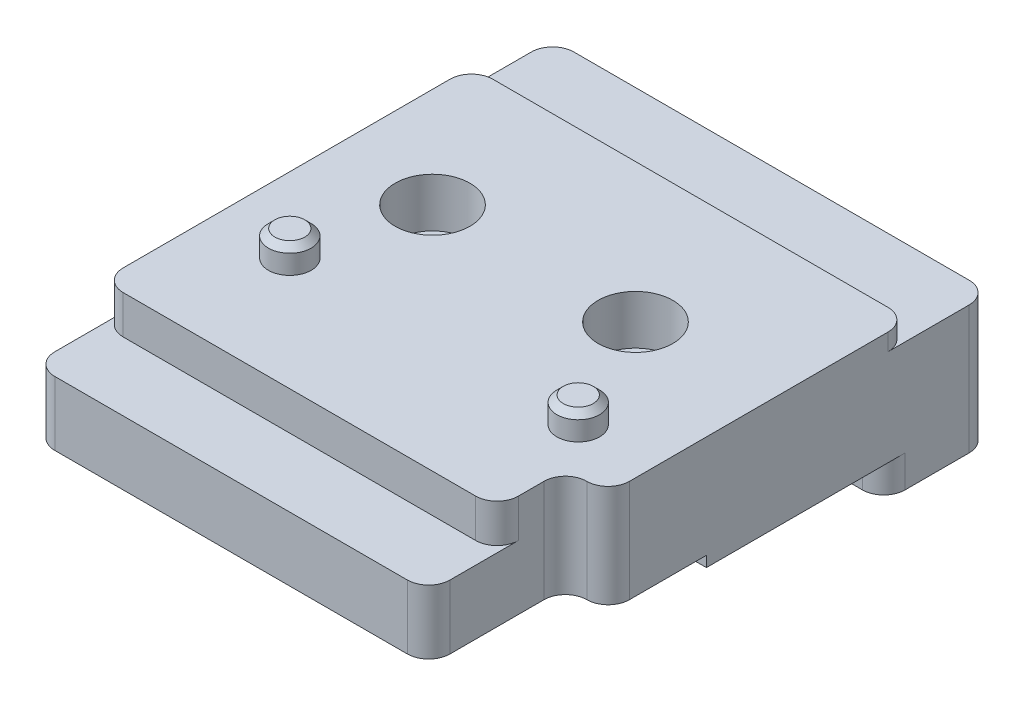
ISO-10303-21;
HEADER;
FILE_DESCRIPTION(('STEP AP214'),'2;1');
FILE_NAME('part.step','',(''),(''),'','','');
FILE_SCHEMA(('AUTOMOTIVE_DESIGN { 1 0 10303 214 1 1 1 1 }'));
ENDSEC;
DATA;
#1=APPLICATION_CONTEXT('core data for automotive mechanical design processes');
#2=APPLICATION_PROTOCOL_DEFINITION('international standard','automotive_design',2000,#1);
#3=PRODUCT_CONTEXT('',#1,'mechanical');
#4=PRODUCT('Part','Part','',(#3));
#5=PRODUCT_RELATED_PRODUCT_CATEGORY('part','',(#4));
#6=PRODUCT_DEFINITION_FORMATION('','',#4);
#7=PRODUCT_DEFINITION_CONTEXT('part definition',#1,'design');
#8=PRODUCT_DEFINITION('design','',#6,#7);
#9=PRODUCT_DEFINITION_SHAPE('','',#8);
#10=(LENGTH_UNIT() NAMED_UNIT(*) SI_UNIT(.MILLI.,.METRE.));
#11=(NAMED_UNIT(*) PLANE_ANGLE_UNIT() SI_UNIT($,.RADIAN.));
#12=(NAMED_UNIT(*) SI_UNIT($,.STERADIAN.) SOLID_ANGLE_UNIT());
#13=UNCERTAINTY_MEASURE_WITH_UNIT(LENGTH_MEASURE(1.E-05),#10,'distance_accuracy_value','');
#14=(GEOMETRIC_REPRESENTATION_CONTEXT(3) GLOBAL_UNCERTAINTY_ASSIGNED_CONTEXT((#13)) GLOBAL_UNIT_ASSIGNED_CONTEXT((#10,
#11,#12)) REPRESENTATION_CONTEXT('',''));
#15=CARTESIAN_POINT('',(0.,0.,0.));
#16=DIRECTION('',(0.,0.,1.));
#17=DIRECTION('',(1.,0.,0.));
#18=AXIS2_PLACEMENT_3D('',#15,#16,#17);
#19=CARTESIAN_POINT('',(-6.74999999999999,0.,0.));
#20=DIRECTION('',(-1.,0.,0.));
#21=DIRECTION('',(0.,0.,1.));
#22=AXIS2_PLACEMENT_3D('',#19,#20,#21);
#23=PLANE('',#22);
#24=DIRECTION('',(0.,0.,1.));
#25=VECTOR('',#24,1.);
#26=CARTESIAN_POINT('',(-6.74999999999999,4.9,-1.5));
#27=LINE('',#26,#25);
#28=CARTESIAN_POINT('',(-6.74999999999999,4.9,-0.5));
#29=VERTEX_POINT('',#28);
#30=CARTESIAN_POINT('',(-6.75,4.9,14.8));
#31=VERTEX_POINT('',#30);
#32=EDGE_CURVE('E404',#29,#31,#27,.T.);
#33=ORIENTED_EDGE('',*,*,#32,.F.);
#34=DIRECTION('',(0.,1.,0.));
#35=VECTOR('',#34,1.);
#36=CARTESIAN_POINT('',(-6.74999999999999,0.,-0.5));
#37=LINE('',#36,#35);
#38=CARTESIAN_POINT('',(-6.74999999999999,4.1,-0.5));
#39=VERTEX_POINT('',#38);
#40=EDGE_CURVE('E360',#29,#39,#37,.F.);
#41=ORIENTED_EDGE('',*,*,#40,.T.);
#42=DIRECTION('',(0.,0.,-1.));
#43=VECTOR('',#42,1.);
#44=CARTESIAN_POINT('',(-6.74999999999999,4.1,9.69999999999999));
#45=LINE('',#44,#43);
#46=CARTESIAN_POINT('',(-6.74999999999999,4.1,-4.3));
#47=VERTEX_POINT('',#46);
#48=EDGE_CURVE('E645',#39,#47,#45,.T.);
#49=ORIENTED_EDGE('',*,*,#48,.T.);
#50=DIRECTION('',(0.,1.,0.));
#51=VECTOR('',#50,1.);
#52=CARTESIAN_POINT('',(-6.74999999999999,0.,-4.3));
#53=LINE('',#52,#51);
#54=CARTESIAN_POINT('',(-6.74999999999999,-0.4,-4.3));
#55=VERTEX_POINT('',#54);
#56=EDGE_CURVE('E316',#47,#55,#53,.F.);
#57=ORIENTED_EDGE('',*,*,#56,.T.);
#58=DIRECTION('',(0.,0.,-1.));
#59=VECTOR('',#58,1.);
#60=CARTESIAN_POINT('',(-6.74999999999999,-0.4,-0.300000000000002));
#61=LINE('',#60,#59);
#62=CARTESIAN_POINT('',(-6.74999999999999,-0.4,-0.300000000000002));
#63=VERTEX_POINT('',#62);
#64=EDGE_CURVE('E298',#63,#55,#61,.T.);
#65=ORIENTED_EDGE('',*,*,#64,.F.);
#66=DIRECTION('',(0.,0.,-1.));
#67=VECTOR('',#66,1.);
#68=CARTESIAN_POINT('',(-6.75,-0.4,19.1));
#69=LINE('',#68,#67);
#70=CARTESIAN_POINT('',(-6.75,-0.4,8.));
#71=VERTEX_POINT('',#70);
#72=EDGE_CURVE('E313',#71,#63,#69,.T.);
#73=ORIENTED_EDGE('',*,*,#72,.F.);
#74=DIRECTION('',(0.,-1.,0.));
#75=VECTOR('',#74,1.);
#76=CARTESIAN_POINT('',(-6.75,0.,8.));
#77=LINE('',#76,#75);
#78=CARTESIAN_POINT('',(-6.74999999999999,0.1,8.));
#79=VERTEX_POINT('',#78);
#80=EDGE_CURVE('E615',#79,#71,#77,.T.);
#81=ORIENTED_EDGE('',*,*,#80,.F.);
#82=DIRECTION('',(0.,0.,-1.));
#83=VECTOR('',#82,1.);
#84=CARTESIAN_POINT('',(-6.75,0.1,18.));
#85=LINE('',#84,#83);
#86=CARTESIAN_POINT('',(-6.75,0.1,18.));
#87=VERTEX_POINT('',#86);
#88=EDGE_CURVE('E628',#87,#79,#85,.T.);
#89=ORIENTED_EDGE('',*,*,#88,.F.);
#90=DIRECTION('',(0.,-1.,0.));
#91=VECTOR('',#90,1.);
#92=CARTESIAN_POINT('',(-6.75,0.,18.));
#93=LINE('',#92,#91);
#94=CARTESIAN_POINT('',(-6.75,3.1,18.));
#95=VERTEX_POINT('',#94);
#96=EDGE_CURVE('E434',#87,#95,#93,.F.);
#97=ORIENTED_EDGE('',*,*,#96,.T.);
#98=DIRECTION('',(0.,0.,1.));
#99=VECTOR('',#98,1.);
#100=CARTESIAN_POINT('',(-6.75,3.1,15.8));
#101=LINE('',#100,#99);
#102=CARTESIAN_POINT('',(-6.74999999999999,3.1,14.8));
#103=VERTEX_POINT('',#102);
#104=EDGE_CURVE('E547',#103,#95,#101,.T.);
#105=ORIENTED_EDGE('',*,*,#104,.F.);
#106=DIRECTION('',(0.,1.,0.));
#107=VECTOR('',#106,1.);
#108=CARTESIAN_POINT('',(-6.75,5.1,14.8));
#109=LINE('',#108,#107);
#110=EDGE_CURVE('E425',#103,#31,#109,.T.);
#111=ORIENTED_EDGE('',*,*,#110,.T.);
#112=EDGE_LOOP('',(#33,#41,#49,#57,#65,#73,#81,#89,#97,#105,#111));
#113=FACE_BOUND('',#112,.T.);
#114=ADVANCED_FACE('F32',(#113),#23,.T.);
#115=CARTESIAN_POINT('',(0.,-1.9,0.));
#116=DIRECTION('',(0.,-1.,0.));
#117=DIRECTION('',(0.,0.,-1.));
#118=AXIS2_PLACEMENT_3D('',#115,#116,#117);
#119=PLANE('',#118);
#120=DIRECTION('',(0.,0.,1.));
#121=VECTOR('',#120,1.);
#122=CARTESIAN_POINT('',(-7.74999999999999,-1.9,-0.300000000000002));
#123=LINE('',#122,#121);
#124=CARTESIAN_POINT('',(-7.74999999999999,-1.9,-4.3));
#125=VERTEX_POINT('',#124);
#126=CARTESIAN_POINT('',(-7.74999999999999,-1.9,-1.3));
#127=VERTEX_POINT('',#126);
#128=EDGE_CURVE('E813',#125,#127,#123,.T.);
#129=ORIENTED_EDGE('',*,*,#128,.F.);
#130=CARTESIAN_POINT('',(-6.74999999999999,-1.9,-4.3));
#131=DIRECTION('',(0.,-1.,0.));
#132=DIRECTION('',(0.,0.,-1.));
#133=AXIS2_PLACEMENT_3D('',#130,#131,#132);
#134=CIRCLE('',#133,1.);
#135=CARTESIAN_POINT('',(-6.74999999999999,-1.9,-5.29999999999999));
#136=VERTEX_POINT('',#135);
#137=EDGE_CURVE('E306',#125,#136,#134,.T.);
#138=ORIENTED_EDGE('',*,*,#137,.T.);
#139=DIRECTION('',(-1.,0.,0.));
#140=VECTOR('',#139,1.);
#141=CARTESIAN_POINT('',(3.38174587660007,-1.9,-5.3));
#142=LINE('',#141,#140);
#143=CARTESIAN_POINT('',(-6.11825412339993,-1.9,-5.3));
#144=VERTEX_POINT('',#143);
#145=EDGE_CURVE('E608',#144,#136,#142,.T.);
#146=ORIENTED_EDGE('',*,*,#145,.F.);
#147=DIRECTION('',(0.,0.,-1.));
#148=VECTOR('',#147,1.);
#149=CARTESIAN_POINT('',(-6.11825412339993,-1.9,11.5994949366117));
#150=LINE('',#149,#148);
#151=CARTESIAN_POINT('',(-6.11825412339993,-1.9,-0.300000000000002));
#152=VERTEX_POINT('',#151);
#153=EDGE_CURVE('E671',#152,#144,#150,.T.);
#154=ORIENTED_EDGE('',*,*,#153,.F.);
#155=DIRECTION('',(-1.,0.,0.));
#156=VECTOR('',#155,1.);
#157=CARTESIAN_POINT('',(13.75,-1.9,-0.3));
#158=LINE('',#157,#156);
#159=CARTESIAN_POINT('',(-6.74999999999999,-1.9,-0.300000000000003));
#160=VERTEX_POINT('',#159);
#161=EDGE_CURVE('E505',#152,#160,#158,.T.);
#162=ORIENTED_EDGE('',*,*,#161,.T.);
#163=CARTESIAN_POINT('',(-6.74999999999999,-1.9,-1.3));
#164=DIRECTION('',(0.,-1.,0.));
#165=DIRECTION('',(0.,0.,-1.));
#166=AXIS2_PLACEMENT_3D('',#163,#164,#165);
#167=CIRCLE('',#166,1.);
#168=EDGE_CURVE('E341',#160,#127,#167,.T.);
#169=ORIENTED_EDGE('',*,*,#168,.T.);
#170=EDGE_LOOP('',(#129,#138,#146,#154,#162,#169));
#171=FACE_BOUND('',#170,.T.);
#172=ADVANCED_FACE('F723',(#171),#119,.T.);
#173=CARTESIAN_POINT('',(13.75,-1.9,-0.3));
#174=DIRECTION('',(0.,0.,-1.));
#175=DIRECTION('',(-1.,0.,0.));
#176=AXIS2_PLACEMENT_3D('',#173,#174,#175);
#177=PLANE('',#176);
#178=DIRECTION('',(1.,0.,0.));
#179=VECTOR('',#178,1.);
#180=CARTESIAN_POINT('',(1.25,-0.400000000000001,-0.300000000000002));
#181=LINE('',#180,#179);
#182=CARTESIAN_POINT('',(-5.52643383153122,-0.400000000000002,-0.300000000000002));
#183=VERTEX_POINT('',#182);
#184=EDGE_CURVE('E321',#63,#183,#181,.T.);
#185=ORIENTED_EDGE('',*,*,#184,.F.);
#186=DIRECTION('',(0.,1.,0.));
#187=VECTOR('',#186,1.);
#188=CARTESIAN_POINT('',(-6.74999999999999,-1.9,-0.300000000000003));
#189=LINE('',#188,#187);
#190=EDGE_CURVE('E54',#63,#160,#189,.F.);
#191=ORIENTED_EDGE('',*,*,#190,.T.);
#192=ORIENTED_EDGE('',*,*,#161,.F.);
#193=CARTESIAN_POINT('',(-2.65415250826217,-2.39999999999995,-0.300000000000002));
#194=DIRECTION('',(0.,0.,-1.));
#195=DIRECTION('',(-1.,0.,0.));
#196=AXIS2_PLACEMENT_3D('',#193,#194,#195);
#197=CIRCLE('',#196,3.5);
#198=EDGE_CURVE('E323',#152,#183,#197,.T.);
#199=ORIENTED_EDGE('',*,*,#198,.T.);
#200=EDGE_LOOP('',(#185,#191,#192,#199));
#201=FACE_BOUND('',#200,.T.);
#202=ADVANCED_FACE('F322',(#201),#177,.F.);
#203=CARTESIAN_POINT('',(0.,-0.4,0.));
#204=DIRECTION('',(0.,-1.,0.));
#205=DIRECTION('',(0.,0.,-1.));
#206=AXIS2_PLACEMENT_3D('',#203,#204,#205);
#207=PLANE('',#206);
#208=CARTESIAN_POINT('',(0.218128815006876,-0.400000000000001,-0.300000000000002));
#209=VERTEX_POINT('',#208);
#210=CARTESIAN_POINT('',(3.97356616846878,-0.400000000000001,-0.300000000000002));
#211=VERTEX_POINT('',#210);
#212=EDGE_CURVE('E328',#209,#211,#181,.T.);
#213=ORIENTED_EDGE('',*,*,#212,.T.);
#214=DIRECTION('',(-1.,0.,0.));
#215=VECTOR('',#214,1.);
#216=CARTESIAN_POINT('',(9.71812881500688,-0.400000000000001,-0.300000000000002));
#217=LINE('',#216,#215);
#218=CARTESIAN_POINT('',(9.71812881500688,-0.400000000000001,-0.300000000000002));
#219=VERTEX_POINT('',#218);
#220=EDGE_CURVE('E856',#219,#211,#217,.T.);
#221=ORIENTED_EDGE('',*,*,#220,.F.);
#222=CARTESIAN_POINT('',(12.75,-0.400000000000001,-0.300000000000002));
#223=VERTEX_POINT('',#222);
#224=EDGE_CURVE('E330',#219,#223,#181,.T.);
#225=ORIENTED_EDGE('',*,*,#224,.T.);
#226=CARTESIAN_POINT('',(12.75,-0.4,-1.3));
#227=DIRECTION('',(0.,-1.,0.));
#228=DIRECTION('',(0.,0.,-1.));
#229=AXIS2_PLACEMENT_3D('',#226,#227,#228);
#230=CIRCLE('',#229,1.);
#231=CARTESIAN_POINT('',(13.75,-0.4,-1.3));
#232=VERTEX_POINT('',#231);
#233=EDGE_CURVE('E369',#223,#232,#230,.F.);
#234=ORIENTED_EDGE('',*,*,#233,.T.);
#235=DIRECTION('',(0.,0.,1.));
#236=VECTOR('',#235,1.);
#237=CARTESIAN_POINT('',(13.75,-0.4,6.2));
#238=LINE('',#237,#236);
#239=CARTESIAN_POINT('',(13.75,-0.4,8.));
#240=VERTEX_POINT('',#239);
#241=EDGE_CURVE('E327',#232,#240,#238,.T.);
#242=ORIENTED_EDGE('',*,*,#241,.T.);
#243=DIRECTION('',(1.,0.,0.));
#244=VECTOR('',#243,1.);
#245=CARTESIAN_POINT('',(13.75,-0.4,8.));
#246=LINE('',#245,#244);
#247=EDGE_CURVE('E337',#71,#240,#246,.T.);
#248=ORIENTED_EDGE('',*,*,#247,.F.);
#249=ORIENTED_EDGE('',*,*,#72,.T.);
#250=ORIENTED_EDGE('',*,*,#184,.T.);
#251=DIRECTION('',(-1.,0.,0.));
#252=VECTOR('',#251,1.);
#253=CARTESIAN_POINT('',(0.218128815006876,-0.400000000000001,-0.300000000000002));
#254=LINE('',#253,#252);
#255=EDGE_CURVE('E317',#209,#183,#254,.T.);
#256=ORIENTED_EDGE('',*,*,#255,.F.);
#257=EDGE_LOOP('',(#213,#221,#225,#234,#242,#248,#249,#250,#256));
#258=FACE_BOUND('',#257,.T.);
#259=CARTESIAN_POINT('',(-2.06999999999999,-0.4,4.99980465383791));
#260=DIRECTION('',(0.,-1.,0.));
#261=DIRECTION('',(0.,0.,-1.));
#262=AXIS2_PLACEMENT_3D('',#259,#260,#261);
#263=CIRCLE('',#262,2.);
#264=CARTESIAN_POINT('',(-2.06999999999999,-0.4,2.99980465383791));
#265=VERTEX_POINT('',#264);
#266=EDGE_CURVE('E413',#265,#265,#263,.T.);
#267=ORIENTED_EDGE('',*,*,#266,.F.);
#268=EDGE_LOOP('',(#267));
#269=FACE_BOUND('',#268,.T.);
#270=CARTESIAN_POINT('',(7.43000000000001,-0.4,4.99980465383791));
#271=DIRECTION('',(0.,-1.,0.));
#272=DIRECTION('',(0.,0.,-1.));
#273=AXIS2_PLACEMENT_3D('',#270,#271,#272);
#274=CIRCLE('',#273,2.);
#275=CARTESIAN_POINT('',(7.43000000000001,-0.4,2.99980465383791));
#276=VERTEX_POINT('',#275);
#277=EDGE_CURVE('E562',#276,#276,#274,.T.);
#278=ORIENTED_EDGE('',*,*,#277,.F.);
#279=EDGE_LOOP('',(#278));
#280=FACE_BOUND('',#279,.T.);
#281=ADVANCED_FACE('F333',(#258,#269,#280),#207,.T.);
#282=CARTESIAN_POINT('',(11.75,4.6,19.1));
#283=DIRECTION('',(-1.,0.,0.));
#284=DIRECTION('',(0.,0.,1.));
#285=AXIS2_PLACEMENT_3D('',#282,#283,#284);
#286=PLANE('',#285);
#287=DIRECTION('',(0.,1.,0.));
#288=VECTOR('',#287,1.);
#289=CARTESIAN_POINT('',(11.75,-0.4,18.));
#290=LINE('',#289,#288);
#291=CARTESIAN_POINT('',(11.75,3.1,18.));
#292=VERTEX_POINT('',#291);
#293=CARTESIAN_POINT('',(11.75,0.1,18.));
#294=VERTEX_POINT('',#293);
#295=EDGE_CURVE('E436',#292,#294,#290,.F.);
#296=ORIENTED_EDGE('',*,*,#295,.T.);
#297=DIRECTION('',(0.,0.,1.));
#298=VECTOR('',#297,1.);
#299=CARTESIAN_POINT('',(11.75,0.1,13.6));
#300=LINE('',#299,#298);
#301=CARTESIAN_POINT('',(11.75,0.1,13.6));
#302=VERTEX_POINT('',#301);
#303=EDGE_CURVE('E639',#302,#294,#300,.T.);
#304=ORIENTED_EDGE('',*,*,#303,.F.);
#305=DIRECTION('',(0.,-1.,0.));
#306=VECTOR('',#305,1.);
#307=CARTESIAN_POINT('',(11.75,5.1,13.6));
#308=LINE('',#307,#306);
#309=CARTESIAN_POINT('',(11.75,4.9,13.6));
#310=VERTEX_POINT('',#309);
#311=EDGE_CURVE('E438',#302,#310,#308,.F.);
#312=ORIENTED_EDGE('',*,*,#311,.T.);
#313=DIRECTION('',(0.,0.,-1.));
#314=VECTOR('',#313,1.);
#315=CARTESIAN_POINT('',(11.75,4.9,14.8));
#316=LINE('',#315,#314);
#317=CARTESIAN_POINT('',(11.75,4.9,14.8));
#318=VERTEX_POINT('',#317);
#319=EDGE_CURVE('E590',#318,#310,#316,.T.);
#320=ORIENTED_EDGE('',*,*,#319,.F.);
#321=DIRECTION('',(0.,1.,0.));
#322=VECTOR('',#321,1.);
#323=CARTESIAN_POINT('',(11.75,4.6,14.8));
#324=LINE('',#323,#322);
#325=CARTESIAN_POINT('',(11.75,3.1,14.8));
#326=VERTEX_POINT('',#325);
#327=EDGE_CURVE('E418',#318,#326,#324,.F.);
#328=ORIENTED_EDGE('',*,*,#327,.T.);
#329=DIRECTION('',(0.,0.,-1.));
#330=VECTOR('',#329,1.);
#331=CARTESIAN_POINT('',(11.75,3.1,18.));
#332=LINE('',#331,#330);
#333=EDGE_CURVE('E553',#292,#326,#332,.T.);
#334=ORIENTED_EDGE('',*,*,#333,.F.);
#335=EDGE_LOOP('',(#296,#304,#312,#320,#328,#334));
#336=FACE_BOUND('',#335,.T.);
#337=ADVANCED_FACE('F733',(#336),#286,.F.);
#338=CARTESIAN_POINT('',(12.75,4.6,13.6));
#339=DIRECTION('',(0.,1.,0.));
#340=DIRECTION('',(0.,0.,1.));
#341=AXIS2_PLACEMENT_3D('',#338,#339,#340);
#342=CYLINDRICAL_SURFACE('',#341,1.);
#343=ORIENTED_EDGE('',*,*,#311,.F.);
#344=CARTESIAN_POINT('',(12.75,0.1,13.6));
#345=DIRECTION('',(0.,1.,0.));
#346=DIRECTION('',(0.,0.,-1.));
#347=AXIS2_PLACEMENT_3D('',#344,#345,#346);
#348=CIRCLE('',#347,0.999999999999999);
#349=CARTESIAN_POINT('',(12.75,0.1,12.6));
#350=VERTEX_POINT('',#349);
#351=EDGE_CURVE('E642',#350,#302,#348,.T.);
#352=ORIENTED_EDGE('',*,*,#351,.F.);
#353=DIRECTION('',(0.,-1.,0.));
#354=VECTOR('',#353,1.);
#355=CARTESIAN_POINT('',(12.75,-0.4,12.6));
#356=LINE('',#355,#354);
#357=CARTESIAN_POINT('',(12.75,4.9,12.6));
#358=VERTEX_POINT('',#357);
#359=EDGE_CURVE('E429',#358,#350,#356,.T.);
#360=ORIENTED_EDGE('',*,*,#359,.F.);
#361=CARTESIAN_POINT('',(12.75,4.9,13.6));
#362=DIRECTION('',(0.,-1.,0.));
#363=DIRECTION('',(0.,0.,1.));
#364=AXIS2_PLACEMENT_3D('',#361,#362,#363);
#365=CIRCLE('',#364,0.999999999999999);
#366=EDGE_CURVE('E588',#310,#358,#365,.T.);
#367=ORIENTED_EDGE('',*,*,#366,.F.);
#368=EDGE_LOOP('',(#343,#352,#360,#367));
#369=FACE_BOUND('',#368,.T.);
#370=ADVANCED_FACE('F763',(#369),#342,.F.);
#371=CARTESIAN_POINT('',(12.75,0.,11.6));
#372=DIRECTION('',(0.,1.,0.));
#373=DIRECTION('',(0.,0.,1.));
#374=AXIS2_PLACEMENT_3D('',#371,#372,#373);
#375=CYLINDRICAL_SURFACE('',#374,1.);
#376=ORIENTED_EDGE('',*,*,#359,.T.);
#377=CARTESIAN_POINT('',(12.75,0.1,11.6));
#378=DIRECTION('',(0.,-1.,0.));
#379=DIRECTION('',(0.,0.,-1.));
#380=AXIS2_PLACEMENT_3D('',#377,#378,#379);
#381=CIRCLE('',#380,1.);
#382=CARTESIAN_POINT('',(13.75,0.1,11.6));
#383=VERTEX_POINT('',#382);
#384=EDGE_CURVE('E620',#383,#350,#381,.T.);
#385=ORIENTED_EDGE('',*,*,#384,.F.);
#386=DIRECTION('',(0.,-1.,0.));
#387=VECTOR('',#386,1.);
#388=CARTESIAN_POINT('',(13.75,-0.4,11.6));
#389=LINE('',#388,#387);
#390=CARTESIAN_POINT('',(13.75,4.9,11.6));
#391=VERTEX_POINT('',#390);
#392=EDGE_CURVE('E428',#391,#383,#389,.T.);
#393=ORIENTED_EDGE('',*,*,#392,.F.);
#394=CARTESIAN_POINT('',(12.75,4.9,11.6));
#395=DIRECTION('',(0.,1.,0.));
#396=DIRECTION('',(0.,0.,1.));
#397=AXIS2_PLACEMENT_3D('',#394,#395,#396);
#398=CIRCLE('',#397,1.);
#399=EDGE_CURVE('E586',#358,#391,#398,.T.);
#400=ORIENTED_EDGE('',*,*,#399,.F.);
#401=EDGE_LOOP('',(#376,#385,#393,#400));
#402=FACE_BOUND('',#401,.T.);
#403=ADVANCED_FACE('F760',(#402),#375,.T.);
#404=CARTESIAN_POINT('',(0.,0.,19.));
#405=DIRECTION('',(0.,0.,1.));
#406=DIRECTION('',(1.,0.,0.));
#407=AXIS2_PLACEMENT_3D('',#404,#405,#406);
#408=PLANE('',#407);
#409=DIRECTION('',(0.,-1.,0.));
#410=VECTOR('',#409,1.);
#411=CARTESIAN_POINT('',(-5.75,0.,19.));
#412=LINE('',#411,#410);
#413=CARTESIAN_POINT('',(-5.75,3.1,19.));
#414=VERTEX_POINT('',#413);
#415=CARTESIAN_POINT('',(-5.75,0.1,19.));
#416=VERTEX_POINT('',#415);
#417=EDGE_CURVE('E442',#414,#416,#412,.T.);
#418=ORIENTED_EDGE('',*,*,#417,.T.);
#419=DIRECTION('',(-1.,0.,0.));
#420=VECTOR('',#419,1.);
#421=CARTESIAN_POINT('',(10.75,0.1,19.));
#422=LINE('',#421,#420);
#423=CARTESIAN_POINT('',(10.75,0.1,19.));
#424=VERTEX_POINT('',#423);
#425=EDGE_CURVE('E633',#424,#416,#422,.T.);
#426=ORIENTED_EDGE('',*,*,#425,.F.);
#427=DIRECTION('',(0.,1.,0.));
#428=VECTOR('',#427,1.);
#429=CARTESIAN_POINT('',(10.75,5.1,19.));
#430=LINE('',#429,#428);
#431=CARTESIAN_POINT('',(10.75,3.1,19.));
#432=VERTEX_POINT('',#431);
#433=EDGE_CURVE('E440',#424,#432,#430,.T.);
#434=ORIENTED_EDGE('',*,*,#433,.T.);
#435=DIRECTION('',(1.,0.,0.));
#436=VECTOR('',#435,1.);
#437=CARTESIAN_POINT('',(-5.75,3.1,19.));
#438=LINE('',#437,#436);
#439=EDGE_CURVE('E542',#414,#432,#438,.T.);
#440=ORIENTED_EDGE('',*,*,#439,.F.);
#441=EDGE_LOOP('',(#418,#426,#434,#440));
#442=FACE_BOUND('',#441,.T.);
#443=ADVANCED_FACE('F755',(#442),#408,.T.);
#444=CARTESIAN_POINT('',(10.75,0.,18.));
#445=DIRECTION('',(0.,-1.,0.));
#446=DIRECTION('',(0.,0.,-1.));
#447=AXIS2_PLACEMENT_3D('',#444,#445,#446);
#448=CYLINDRICAL_SURFACE('',#447,1.);
#449=ORIENTED_EDGE('',*,*,#433,.F.);
#450=CARTESIAN_POINT('',(10.75,0.1,18.));
#451=DIRECTION('',(0.,-1.,0.));
#452=DIRECTION('',(0.,0.,-1.));
#453=AXIS2_PLACEMENT_3D('',#450,#451,#452);
#454=CIRCLE('',#453,1.);
#455=EDGE_CURVE('E636',#294,#424,#454,.T.);
#456=ORIENTED_EDGE('',*,*,#455,.F.);
#457=ORIENTED_EDGE('',*,*,#295,.F.);
#458=CARTESIAN_POINT('',(10.75,3.1,18.));
#459=DIRECTION('',(0.,1.,0.));
#460=DIRECTION('',(0.,0.,1.));
#461=AXIS2_PLACEMENT_3D('',#458,#459,#460);
#462=CIRCLE('',#461,1.);
#463=EDGE_CURVE('E432',#432,#292,#462,.T.);
#464=ORIENTED_EDGE('',*,*,#463,.F.);
#465=EDGE_LOOP('',(#449,#456,#457,#464));
#466=FACE_BOUND('',#465,.T.);
#467=ADVANCED_FACE('F752',(#466),#448,.T.);
#468=CARTESIAN_POINT('',(-5.75,0.,18.));
#469=DIRECTION('',(0.,-1.,0.));
#470=DIRECTION('',(0.,0.,-1.));
#471=AXIS2_PLACEMENT_3D('',#468,#469,#470);
#472=CYLINDRICAL_SURFACE('',#471,1.);
#473=ORIENTED_EDGE('',*,*,#96,.F.);
#474=CARTESIAN_POINT('',(-5.75,0.1,18.));
#475=DIRECTION('',(0.,-1.,0.));
#476=DIRECTION('',(0.,0.,-1.));
#477=AXIS2_PLACEMENT_3D('',#474,#475,#476);
#478=CIRCLE('',#477,1.);
#479=EDGE_CURVE('E630',#416,#87,#478,.T.);
#480=ORIENTED_EDGE('',*,*,#479,.F.);
#481=ORIENTED_EDGE('',*,*,#417,.F.);
#482=CARTESIAN_POINT('',(-5.75,3.1,18.));
#483=DIRECTION('',(0.,1.,0.));
#484=DIRECTION('',(0.,0.,1.));
#485=AXIS2_PLACEMENT_3D('',#482,#483,#484);
#486=CIRCLE('',#485,1.);
#487=EDGE_CURVE('E545',#95,#414,#486,.T.);
#488=ORIENTED_EDGE('',*,*,#487,.F.);
#489=EDGE_LOOP('',(#473,#480,#481,#488));
#490=FACE_BOUND('',#489,.T.);
#491=ADVANCED_FACE('F738',(#490),#472,.T.);
#492=CARTESIAN_POINT('',(13.75,0.,21.8925824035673));
#493=DIRECTION('',(1.,0.,0.));
#494=DIRECTION('',(0.,0.,-1.));
#495=AXIS2_PLACEMENT_3D('',#492,#493,#494);
#496=PLANE('',#495);
#497=DIRECTION('',(0.,0.,1.));
#498=VECTOR('',#497,1.);
#499=CARTESIAN_POINT('',(13.75,0.1,8.));
#500=LINE('',#499,#498);
#501=CARTESIAN_POINT('',(13.75,0.1,8.));
#502=VERTEX_POINT('',#501);
#503=EDGE_CURVE('E623',#502,#383,#500,.T.);
#504=ORIENTED_EDGE('',*,*,#503,.F.);
#505=DIRECTION('',(0.,-1.,0.));
#506=VECTOR('',#505,1.);
#507=CARTESIAN_POINT('',(13.75,0.6,8.));
#508=LINE('',#507,#506);
#509=EDGE_CURVE('E617',#502,#240,#508,.T.);
#510=ORIENTED_EDGE('',*,*,#509,.T.);
#511=ORIENTED_EDGE('',*,*,#241,.F.);
#512=DIRECTION('',(0.,1.,0.));
#513=VECTOR('',#512,1.);
#514=CARTESIAN_POINT('',(13.75,-1.9,-1.3));
#515=LINE('',#514,#513);
#516=CARTESIAN_POINT('',(13.75,-1.9,-1.3));
#517=VERTEX_POINT('',#516);
#518=EDGE_CURVE('E394',#232,#517,#515,.F.);
#519=ORIENTED_EDGE('',*,*,#518,.T.);
#520=DIRECTION('',(0.,0.,1.));
#521=VECTOR('',#520,1.);
#522=CARTESIAN_POINT('',(13.75,-1.9,-5.8));
#523=LINE('',#522,#521);
#524=CARTESIAN_POINT('',(13.75,-1.9,-4.3));
#525=VERTEX_POINT('',#524);
#526=EDGE_CURVE('E506',#525,#517,#523,.T.);
#527=ORIENTED_EDGE('',*,*,#526,.F.);
#528=DIRECTION('',(0.,-1.,0.));
#529=VECTOR('',#528,1.);
#530=CARTESIAN_POINT('',(13.75,0.,-4.3));
#531=LINE('',#530,#529);
#532=CARTESIAN_POINT('',(13.75,4.1,-4.3));
#533=VERTEX_POINT('',#532);
#534=EDGE_CURVE('E392',#525,#533,#531,.F.);
#535=ORIENTED_EDGE('',*,*,#534,.T.);
#536=DIRECTION('',(0.,0.,-1.));
#537=VECTOR('',#536,1.);
#538=CARTESIAN_POINT('',(13.75,4.1,21.8925824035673));
#539=LINE('',#538,#537);
#540=CARTESIAN_POINT('',(13.75,4.1,-0.5));
#541=VERTEX_POINT('',#540);
#542=EDGE_CURVE('E338',#541,#533,#539,.T.);
#543=ORIENTED_EDGE('',*,*,#542,.F.);
#544=DIRECTION('',(0.,-1.,0.));
#545=VECTOR('',#544,1.);
#546=CARTESIAN_POINT('',(13.75,0.,-0.5));
#547=LINE('',#546,#545);
#548=CARTESIAN_POINT('',(13.75,4.9,-0.499999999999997));
#549=VERTEX_POINT('',#548);
#550=EDGE_CURVE('E390',#541,#549,#547,.F.);
#551=ORIENTED_EDGE('',*,*,#550,.T.);
#552=DIRECTION('',(0.,0.,-1.));
#553=VECTOR('',#552,1.);
#554=CARTESIAN_POINT('',(13.75,4.9,11.6));
#555=LINE('',#554,#553);
#556=EDGE_CURVE('E583',#391,#549,#555,.T.);
#557=ORIENTED_EDGE('',*,*,#556,.F.);
#558=ORIENTED_EDGE('',*,*,#392,.T.);
#559=EDGE_LOOP('',(#504,#510,#511,#519,#527,#535,#543,#551,#557,#558));
#560=FACE_BOUND('',#559,.T.);
#561=ADVANCED_FACE('F735',(#560),#496,.T.);
#562=DIRECTION('',(-1.,0.,0.));
#563=VECTOR('',#562,1.);
#564=CARTESIAN_POINT('',(13.75,-1.9,-5.3));
#565=LINE('',#564,#563);
#566=CARTESIAN_POINT('',(12.75,-1.9,-5.3));
#567=VERTEX_POINT('',#566);
#568=CARTESIAN_POINT('',(10.3099491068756,-1.9,-5.3));
#569=VERTEX_POINT('',#568);
#570=EDGE_CURVE('E611',#567,#569,#565,.T.);
#571=ORIENTED_EDGE('',*,*,#570,.F.);
#572=CARTESIAN_POINT('',(12.75,-1.9,-4.3));
#573=DIRECTION('',(0.,-1.,0.));
#574=DIRECTION('',(0.,0.,-1.));
#575=AXIS2_PLACEMENT_3D('',#572,#573,#574);
#576=CIRCLE('',#575,1.);
#577=EDGE_CURVE('E381',#567,#525,#576,.T.);
#578=ORIENTED_EDGE('',*,*,#577,.T.);
#579=ORIENTED_EDGE('',*,*,#526,.T.);
#580=CARTESIAN_POINT('',(12.75,-1.9,-1.3));
#581=DIRECTION('',(0.,-1.,0.));
#582=DIRECTION('',(0.,0.,-1.));
#583=AXIS2_PLACEMENT_3D('',#580,#581,#582);
#584=CIRCLE('',#583,1.);
#585=CARTESIAN_POINT('',(12.75,-1.9,-0.3));
#586=VERTEX_POINT('',#585);
#587=EDGE_CURVE('E383',#517,#586,#584,.T.);
#588=ORIENTED_EDGE('',*,*,#587,.T.);
#589=CARTESIAN_POINT('',(10.3099491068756,-1.9,-0.300000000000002));
#590=VERTEX_POINT('',#589);
#591=EDGE_CURVE('E502',#586,#590,#158,.T.);
#592=ORIENTED_EDGE('',*,*,#591,.T.);
#593=DIRECTION('',(0.,0.,1.));
#594=VECTOR('',#593,1.);
#595=CARTESIAN_POINT('',(10.3099491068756,-1.9,-5.8));
#596=LINE('',#595,#594);
#597=EDGE_CURVE('E484',#569,#590,#596,.T.);
#598=ORIENTED_EDGE('',*,*,#597,.F.);
#599=EDGE_LOOP('',(#571,#578,#579,#588,#592,#598));
#600=FACE_BOUND('',#599,.T.);
#601=ADVANCED_FACE('F730',(#600),#119,.T.);
#602=DIRECTION('',(0.,0.,-1.));
#603=VECTOR('',#602,1.);
#604=CARTESIAN_POINT('',(0.809949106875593,-1.9,11.5994949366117));
#605=LINE('',#604,#603);
#606=CARTESIAN_POINT('',(0.809949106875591,-1.9,-5.3));
#607=VERTEX_POINT('',#606);
#608=CARTESIAN_POINT('',(0.809949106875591,-1.9,-0.300000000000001));
#609=VERTEX_POINT('',#608);
#610=EDGE_CURVE('E673',#607,#609,#605,.F.);
#611=ORIENTED_EDGE('',*,*,#610,.F.);
#612=CARTESIAN_POINT('',(3.38174587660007,-1.9,-5.3));
#613=VERTEX_POINT('',#612);
#614=EDGE_CURVE('E605',#613,#607,#142,.T.);
#615=ORIENTED_EDGE('',*,*,#614,.F.);
#616=DIRECTION('',(0.,0.,1.));
#617=VECTOR('',#616,1.);
#618=CARTESIAN_POINT('',(3.38174587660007,-1.9,-5.8));
#619=LINE('',#618,#617);
#620=CARTESIAN_POINT('',(3.38174587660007,-1.9,-0.300000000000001));
#621=VERTEX_POINT('',#620);
#622=EDGE_CURVE('E487',#621,#613,#619,.F.);
#623=ORIENTED_EDGE('',*,*,#622,.F.);
#624=EDGE_CURVE('E504',#621,#609,#158,.T.);
#625=ORIENTED_EDGE('',*,*,#624,.T.);
#626=EDGE_LOOP('',(#611,#615,#623,#625));
#627=FACE_BOUND('',#626,.T.);
#628=ADVANCED_FACE('F729',(#627),#119,.T.);
#629=CARTESIAN_POINT('',(6.84584749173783,-2.39999999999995,-5.8));
#630=DIRECTION('',(0.,0.,1.));
#631=DIRECTION('',(1.,0.,0.));
#632=AXIS2_PLACEMENT_3D('',#629,#630,#631);
#633=CYLINDRICAL_SURFACE('',#632,3.5);
#634=DIRECTION('',(0.,0.,1.));
#635=VECTOR('',#634,1.);
#636=CARTESIAN_POINT('',(7.34584749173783,1.0641016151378,-5.8));
#637=LINE('',#636,#635);
#638=CARTESIAN_POINT('',(7.34584749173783,1.0641016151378,-1.05));
#639=VERTEX_POINT('',#638);
#640=CARTESIAN_POINT('',(7.34584749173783,1.0641016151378,-4.05));
#641=VERTEX_POINT('',#640);
#642=EDGE_CURVE('E481',#639,#641,#637,.F.);
#643=ORIENTED_EDGE('',*,*,#642,.T.);
#644=CARTESIAN_POINT('',(7.34584749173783,1.0641016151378,-4.05));
#645=CARTESIAN_POINT('',(7.34587205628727,1.06408841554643,-4.07797686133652));
#646=CARTESIAN_POINT('',(7.34350092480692,1.06444017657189,-4.10594332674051));
#647=CARTESIAN_POINT('',(7.33415239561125,1.06577526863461,-4.16104821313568));
#648=CARTESIAN_POINT('',(7.32718033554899,1.06675786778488,-4.1881875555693));
#649=CARTESIAN_POINT('',(7.30881167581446,1.0692570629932,-4.24090684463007));
#650=CARTESIAN_POINT('',(7.29741381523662,1.07077381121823,-4.26648634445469));
#651=CARTESIAN_POINT('',(7.27053157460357,1.0741657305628,-4.31536967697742));
#652=CARTESIAN_POINT('',(7.25504736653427,1.07604088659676,-4.33867360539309));
#653=CARTESIAN_POINT('',(7.2203118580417,1.07995439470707,-4.38251106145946));
#654=CARTESIAN_POINT('',(7.20103708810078,1.0819937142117,-4.40302590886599));
#655=CARTESIAN_POINT('',(7.15931645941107,1.08599708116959,-4.44054367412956));
#656=CARTESIAN_POINT('',(7.13687011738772,1.08796111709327,-4.45754605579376));
#657=CARTESIAN_POINT('',(7.08932439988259,1.09160264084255,-4.4876227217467));
#658=CARTESIAN_POINT('',(7.06421396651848,1.09327885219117,-4.50067969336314));
#659=CARTESIAN_POINT('',(7.01213009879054,1.09614494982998,-4.52238318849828));
#660=CARTESIAN_POINT('',(6.98515686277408,1.0973348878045,-4.53103018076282));
#661=CARTESIAN_POINT('',(6.93030633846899,1.09908761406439,-4.54361222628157));
#662=CARTESIAN_POINT('',(6.90243644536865,1.09965461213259,-4.5475789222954));
#663=CARTESIAN_POINT('',(6.8464205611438,1.10011199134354,-4.55078599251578));
#664=CARTESIAN_POINT('',(6.81827457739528,1.10000239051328,-4.55002649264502));
#665=CARTESIAN_POINT('',(6.76272266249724,1.09912227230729,-4.5438276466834));
#666=CARTESIAN_POINT('',(6.73531283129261,1.09835658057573,-4.53842246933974));
#667=CARTESIAN_POINT('',(6.68179344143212,1.09625570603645,-4.52313930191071));
#668=CARTESIAN_POINT('',(6.65568390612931,1.09492051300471,-4.51326123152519));
#669=CARTESIAN_POINT('',(6.6054014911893,1.09182231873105,-4.48927707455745));
#670=CARTESIAN_POINT('',(6.5812356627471,1.09005784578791,-4.47515640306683));
#671=CARTESIAN_POINT('',(6.53560467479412,1.08629808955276,-4.44309914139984));
#672=CARTESIAN_POINT('',(6.51413956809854,1.08430280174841,-4.4251624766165));
#673=CARTESIAN_POINT('',(6.47431958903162,1.08028328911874,-4.38579422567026));
#674=CARTESIAN_POINT('',(6.45599374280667,1.07825896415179,-4.36433327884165));
#675=CARTESIAN_POINT('',(6.42319427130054,1.07442630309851,-4.31861819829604));
#676=CARTESIAN_POINT('',(6.40872177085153,1.07261803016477,-4.29436325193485));
#677=CARTESIAN_POINT('',(6.38403498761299,1.0694213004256,-4.24371216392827));
#678=CARTESIAN_POINT('',(6.37382600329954,1.06803336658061,-4.21731340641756));
#679=CARTESIAN_POINT('',(6.35801399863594,1.06584566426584,-4.16318333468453));
#680=CARTESIAN_POINT('',(6.35240406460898,1.06504501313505,-4.13545408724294));
#681=CARTESIAN_POINT('',(6.34694973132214,1.06426000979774,-4.08838517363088));
#682=CARTESIAN_POINT('',(6.3458376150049,1.06409681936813,-4.06918837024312));
#683=CARTESIAN_POINT('',(6.34584749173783,1.0641016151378,-4.05));
#684=B_SPLINE_CURVE_WITH_KNOTS('',3,(#644,#645,#646,#647,#648,#649,#650,#651,#652,#653,#654,
#655,#656,#657,#658,#659,#660,#661,#662,#663,#664,#665,#666,#667,#668,#669,#670,#671,#672,#673,
#674,#675,#676,#677,#678,#679,#680,#681,#682,#683),.UNSPECIFIED.,.F.,.F.,(4,2,2,2,2,2,2,2,2,2,2,
2,2,2,2,2,2,2,2,4),(0.,0.0838126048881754,0.167528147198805,0.251267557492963,0.335003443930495,
0.419275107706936,0.503559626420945,0.588208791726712,0.672848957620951,0.756913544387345,
0.840975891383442,0.924425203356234,1.00787601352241,1.09161705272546,1.1753597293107,
1.25983919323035,1.34434329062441,1.42895209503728,1.51343347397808,1.57098907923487),.UNSPECIFIED.);
#685=CARTESIAN_POINT('',(6.34584749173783,1.0641016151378,-4.05));
#686=VERTEX_POINT('',#685);
#687=EDGE_CURVE('E444',#641,#686,#684,.T.);
#688=ORIENTED_EDGE('',*,*,#687,.T.);
#689=DIRECTION('',(0.,0.,1.));
#690=VECTOR('',#689,1.);
#691=CARTESIAN_POINT('',(6.34584749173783,1.0641016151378,-5.8));
#692=LINE('',#691,#690);
#693=CARTESIAN_POINT('',(6.34584749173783,1.0641016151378,-1.05));
#694=VERTEX_POINT('',#693);
#695=EDGE_CURVE('E452',#686,#694,#692,.T.);
#696=ORIENTED_EDGE('',*,*,#695,.T.);
#697=CARTESIAN_POINT('',(6.34584749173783,1.0641016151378,-1.05));
#698=CARTESIAN_POINT('',(6.34582292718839,1.06408841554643,-1.02202313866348));
#699=CARTESIAN_POINT('',(6.34819405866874,1.06444017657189,-0.994056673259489));
#700=CARTESIAN_POINT('',(6.35754258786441,1.06577526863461,-0.93895178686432));
#701=CARTESIAN_POINT('',(6.36451464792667,1.06675786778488,-0.911812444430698));
#702=CARTESIAN_POINT('',(6.3828833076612,1.0692570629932,-0.859093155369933));
#703=CARTESIAN_POINT('',(6.39428116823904,1.07077381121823,-0.833513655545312));
#704=CARTESIAN_POINT('',(6.42116340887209,1.0741657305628,-0.784630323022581));
#705=CARTESIAN_POINT('',(6.43664761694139,1.07604088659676,-0.761326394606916));
#706=CARTESIAN_POINT('',(6.47138312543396,1.07995439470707,-0.717488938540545));
#707=CARTESIAN_POINT('',(6.49065789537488,1.0819937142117,-0.69697409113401));
#708=CARTESIAN_POINT('',(6.53237852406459,1.08599708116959,-0.65945632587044));
#709=CARTESIAN_POINT('',(6.55482486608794,1.08796111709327,-0.642453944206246));
#710=CARTESIAN_POINT('',(6.60237058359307,1.09160264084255,-0.612377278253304));
#711=CARTESIAN_POINT('',(6.62748101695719,1.09327885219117,-0.599320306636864));
#712=CARTESIAN_POINT('',(6.67956488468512,1.09614494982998,-0.577616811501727));
#713=CARTESIAN_POINT('',(6.70653812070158,1.09733488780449,-0.568969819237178));
#714=CARTESIAN_POINT('',(6.76138864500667,1.09908761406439,-0.556387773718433));
#715=CARTESIAN_POINT('',(6.78925853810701,1.09965461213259,-0.552421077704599));
#716=CARTESIAN_POINT('',(6.84527442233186,1.10011199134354,-0.549214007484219));
#717=CARTESIAN_POINT('',(6.87342040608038,1.10000239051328,-0.549973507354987));
#718=CARTESIAN_POINT('',(6.92897232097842,1.09912227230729,-0.5561723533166));
#719=CARTESIAN_POINT('',(6.95638215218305,1.09835658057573,-0.561577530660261));
#720=CARTESIAN_POINT('',(7.00990154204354,1.09625570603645,-0.57686069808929));
#721=CARTESIAN_POINT('',(7.03601107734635,1.09492051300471,-0.586738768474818));
#722=CARTESIAN_POINT('',(7.08629349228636,1.09182231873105,-0.610722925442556));
#723=CARTESIAN_POINT('',(7.11045932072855,1.09005784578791,-0.624843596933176));
#724=CARTESIAN_POINT('',(7.15609030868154,1.08629808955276,-0.656900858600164));
#725=CARTESIAN_POINT('',(7.17755541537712,1.08430280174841,-0.674837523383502));
#726=CARTESIAN_POINT('',(7.21737539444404,1.08028328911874,-0.714205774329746));
#727=CARTESIAN_POINT('',(7.23570124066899,1.07825896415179,-0.735666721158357));
#728=CARTESIAN_POINT('',(7.26850071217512,1.07442630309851,-0.781381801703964));
#729=CARTESIAN_POINT('',(7.28297321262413,1.07261803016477,-0.805636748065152));
#730=CARTESIAN_POINT('',(7.30765999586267,1.0694213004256,-0.856287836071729));
#731=CARTESIAN_POINT('',(7.31786898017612,1.06803336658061,-0.882686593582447));
#732=CARTESIAN_POINT('',(7.33368098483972,1.06584566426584,-0.936816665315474));
#733=CARTESIAN_POINT('',(7.33929091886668,1.06504501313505,-0.964545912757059));
#734=CARTESIAN_POINT('',(7.34474525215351,1.06426000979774,-1.01161482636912));
#735=CARTESIAN_POINT('',(7.34585736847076,1.06409681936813,-1.03081162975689));
#736=CARTESIAN_POINT('',(7.34584749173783,1.0641016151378,-1.05));
#737=B_SPLINE_CURVE_WITH_KNOTS('',3,(#697,#698,#699,#700,#701,#702,#703,#704,#705,#706,#707,
#708,#709,#710,#711,#712,#713,#714,#715,#716,#717,#718,#719,#720,#721,#722,#723,#724,#725,#726,
#727,#728,#729,#730,#731,#732,#733,#734,#735,#736),.UNSPECIFIED.,.F.,.F.,(4,2,2,2,2,2,2,2,2,2,2,
2,2,2,2,2,2,2,2,4),(0.,0.0838126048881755,0.167528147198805,0.251267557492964,0.335003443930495,
0.419275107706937,0.503559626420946,0.588208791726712,0.67284895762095,0.756913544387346,
0.840975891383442,0.924425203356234,1.00787601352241,1.09161705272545,1.1753597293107,
1.25983919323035,1.34434329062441,1.42895209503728,1.51343347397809,1.57098907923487),.UNSPECIFIED.);
#738=EDGE_CURVE('E475',#694,#639,#737,.T.);
#739=ORIENTED_EDGE('',*,*,#738,.T.);
#740=EDGE_LOOP('',(#643,#688,#696,#739));
#741=FACE_BOUND('',#740,.T.);
#742=CARTESIAN_POINT('',(6.84584749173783,-2.39999999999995,-0.300000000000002));
#743=DIRECTION('',(0.,0.,1.));
#744=DIRECTION('',(1.,0.,0.));
#745=AXIS2_PLACEMENT_3D('',#742,#743,#744);
#746=CIRCLE('',#745,3.5);
#747=EDGE_CURVE('E509',#590,#219,#746,.T.);
#748=ORIENTED_EDGE('',*,*,#747,.T.);
#749=CARTESIAN_POINT('',(6.84584749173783,-2.39999999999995,-0.300000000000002));
#750=DIRECTION('',(0.,0.,-1.));
#751=DIRECTION('',(-1.,0.,0.));
#752=AXIS2_PLACEMENT_3D('',#749,#750,#751);
#753=CIRCLE('',#752,3.5);
#754=EDGE_CURVE('E854',#211,#219,#753,.T.);
#755=ORIENTED_EDGE('',*,*,#754,.F.);
#756=EDGE_CURVE('E512',#211,#621,#746,.T.);
#757=ORIENTED_EDGE('',*,*,#756,.T.);
#758=ORIENTED_EDGE('',*,*,#622,.T.);
#759=CARTESIAN_POINT('',(6.84584749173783,-2.39999999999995,-5.3));
#760=DIRECTION('',(0.,0.,1.));
#761=DIRECTION('',(-1.,0.,0.));
#762=AXIS2_PLACEMENT_3D('',#759,#760,#761);
#763=CIRCLE('',#762,3.5);
#764=EDGE_CURVE('E609',#569,#613,#763,.T.);
#765=ORIENTED_EDGE('',*,*,#764,.F.);
#766=ORIENTED_EDGE('',*,*,#597,.T.);
#767=EDGE_LOOP('',(#748,#755,#757,#758,#765,#766));
#768=FACE_BOUND('',#767,.T.);
#769=ADVANCED_FACE('F454',(#741,#768),#633,.F.);
#770=CARTESIAN_POINT('',(0.,4.1,0.));
#771=DIRECTION('',(0.,-1.,0.));
#772=DIRECTION('',(0.,0.,-1.));
#773=AXIS2_PLACEMENT_3D('',#770,#771,#772);
#774=PLANE('',#773);
#775=DIRECTION('',(1.,0.,0.));
#776=VECTOR('',#775,1.);
#777=CARTESIAN_POINT('',(1.25,4.1,-5.3));
#778=LINE('',#777,#776);
#779=CARTESIAN_POINT('',(-5.74999999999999,4.1,-5.3));
#780=VERTEX_POINT('',#779);
#781=CARTESIAN_POINT('',(12.75,4.1,-5.3));
#782=VERTEX_POINT('',#781);
#783=EDGE_CURVE('E613',#780,#782,#778,.T.);
#784=ORIENTED_EDGE('',*,*,#783,.F.);
#785=CARTESIAN_POINT('',(-5.74999999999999,4.1,-4.3));
#786=DIRECTION('',(0.,-1.,0.));
#787=DIRECTION('',(0.,0.,-1.));
#788=AXIS2_PLACEMENT_3D('',#785,#786,#787);
#789=CIRCLE('',#788,1.);
#790=EDGE_CURVE('E352',#780,#47,#789,.F.);
#791=ORIENTED_EDGE('',*,*,#790,.T.);
#792=ORIENTED_EDGE('',*,*,#48,.F.);
#793=CARTESIAN_POINT('',(-5.74999999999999,4.1,-0.5));
#794=DIRECTION('',(0.,-1.,0.));
#795=DIRECTION('',(0.,0.,-1.));
#796=AXIS2_PLACEMENT_3D('',#793,#794,#795);
#797=CIRCLE('',#796,1.);
#798=CARTESIAN_POINT('',(-5.74999999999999,4.1,-1.5));
#799=VERTEX_POINT('',#798);
#800=EDGE_CURVE('E40',#39,#799,#797,.T.);
#801=ORIENTED_EDGE('',*,*,#800,.T.);
#802=DIRECTION('',(-1.,0.,0.));
#803=VECTOR('',#802,1.);
#804=CARTESIAN_POINT('',(13.75,4.1,-1.5));
#805=LINE('',#804,#803);
#806=CARTESIAN_POINT('',(12.75,4.1,-1.5));
#807=VERTEX_POINT('',#806);
#808=EDGE_CURVE('E431',#807,#799,#805,.T.);
#809=ORIENTED_EDGE('',*,*,#808,.F.);
#810=CARTESIAN_POINT('',(12.75,4.1,-0.5));
#811=DIRECTION('',(0.,-1.,0.));
#812=DIRECTION('',(0.,0.,-1.));
#813=AXIS2_PLACEMENT_3D('',#810,#811,#812);
#814=CIRCLE('',#813,1.);
#815=EDGE_CURVE('E372',#807,#541,#814,.T.);
#816=ORIENTED_EDGE('',*,*,#815,.T.);
#817=ORIENTED_EDGE('',*,*,#542,.T.);
#818=CARTESIAN_POINT('',(12.75,4.1,-4.3));
#819=DIRECTION('',(0.,-1.,0.));
#820=DIRECTION('',(0.,0.,-1.));
#821=AXIS2_PLACEMENT_3D('',#818,#819,#820);
#822=CIRCLE('',#821,1.);
#823=EDGE_CURVE('E378',#533,#782,#822,.F.);
#824=ORIENTED_EDGE('',*,*,#823,.T.);
#825=EDGE_LOOP('',(#784,#791,#792,#801,#809,#816,#817,#824));
#826=FACE_BOUND('',#825,.T.);
#827=ADVANCED_FACE('F927',(#826),#774,.F.);
#828=CARTESIAN_POINT('',(0.,0.,-1.5));
#829=DIRECTION('',(0.,0.,-1.));
#830=DIRECTION('',(-1.,0.,0.));
#831=AXIS2_PLACEMENT_3D('',#828,#829,#830);
#832=PLANE('',#831);
#833=ORIENTED_EDGE('',*,*,#808,.T.);
#834=DIRECTION('',(0.,1.,0.));
#835=VECTOR('',#834,1.);
#836=CARTESIAN_POINT('',(-5.74999999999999,0.,-1.5));
#837=LINE('',#836,#835);
#838=CARTESIAN_POINT('',(-5.74999999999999,4.9,-1.5));
#839=VERTEX_POINT('',#838);
#840=EDGE_CURVE('E366',#799,#839,#837,.T.);
#841=ORIENTED_EDGE('',*,*,#840,.T.);
#842=DIRECTION('',(-1.,0.,0.));
#843=VECTOR('',#842,1.);
#844=CARTESIAN_POINT('',(13.75,4.9,-1.5));
#845=LINE('',#844,#843);
#846=CARTESIAN_POINT('',(12.75,4.9,-1.5));
#847=VERTEX_POINT('',#846);
#848=EDGE_CURVE('E580',#847,#839,#845,.T.);
#849=ORIENTED_EDGE('',*,*,#848,.F.);
#850=DIRECTION('',(0.,-1.,0.));
#851=VECTOR('',#850,1.);
#852=CARTESIAN_POINT('',(12.75,0.,-1.5));
#853=LINE('',#852,#851);
#854=EDGE_CURVE('E396',#847,#807,#853,.T.);
#855=ORIENTED_EDGE('',*,*,#854,.T.);
#856=EDGE_LOOP('',(#833,#841,#849,#855));
#857=FACE_BOUND('',#856,.T.);
#858=ADVANCED_FACE('F929',(#857),#832,.T.);
#859=CARTESIAN_POINT('',(11.75,3.1,15.8));
#860=DIRECTION('',(0.,0.,-1.));
#861=DIRECTION('',(-1.,0.,0.));
#862=AXIS2_PLACEMENT_3D('',#859,#860,#861);
#863=PLANE('',#862);
#864=DIRECTION('',(1.,0.,0.));
#865=VECTOR('',#864,1.);
#866=CARTESIAN_POINT('',(-5.75,4.9,15.8));
#867=LINE('',#866,#865);
#868=CARTESIAN_POINT('',(-5.75,4.9,15.8));
#869=VERTEX_POINT('',#868);
#870=CARTESIAN_POINT('',(10.75,4.9,15.8));
#871=VERTEX_POINT('',#870);
#872=EDGE_CURVE('E595',#869,#871,#867,.T.);
#873=ORIENTED_EDGE('',*,*,#872,.F.);
#874=DIRECTION('',(0.,1.,0.));
#875=VECTOR('',#874,1.);
#876=CARTESIAN_POINT('',(-5.75,3.1,15.8));
#877=LINE('',#876,#875);
#878=CARTESIAN_POINT('',(-5.75,3.1,15.8));
#879=VERTEX_POINT('',#878);
#880=EDGE_CURVE('E420',#869,#879,#877,.F.);
#881=ORIENTED_EDGE('',*,*,#880,.T.);
#882=DIRECTION('',(-1.,0.,0.));
#883=VECTOR('',#882,1.);
#884=CARTESIAN_POINT('',(11.75,3.1,15.8));
#885=LINE('',#884,#883);
#886=CARTESIAN_POINT('',(10.75,3.1,15.8));
#887=VERTEX_POINT('',#886);
#888=EDGE_CURVE('E550',#887,#879,#885,.T.);
#889=ORIENTED_EDGE('',*,*,#888,.F.);
#890=DIRECTION('',(0.,1.,0.));
#891=VECTOR('',#890,1.);
#892=CARTESIAN_POINT('',(10.75,3.1,15.8));
#893=LINE('',#892,#891);
#894=EDGE_CURVE('E422',#887,#871,#893,.T.);
#895=ORIENTED_EDGE('',*,*,#894,.T.);
#896=EDGE_LOOP('',(#873,#881,#889,#895));
#897=FACE_BOUND('',#896,.T.);
#898=ADVANCED_FACE('F772',(#897),#863,.F.);
#899=CARTESIAN_POINT('',(-5.75,0.,14.8));
#900=DIRECTION('',(0.,-1.,0.));
#901=DIRECTION('',(0.,0.,-1.));
#902=AXIS2_PLACEMENT_3D('',#899,#900,#901);
#903=CYLINDRICAL_SURFACE('',#902,1.);
#904=ORIENTED_EDGE('',*,*,#880,.F.);
#905=CARTESIAN_POINT('',(-5.75,4.9,14.8));
#906=DIRECTION('',(0.,1.,0.));
#907=DIRECTION('',(0.,0.,1.));
#908=AXIS2_PLACEMENT_3D('',#905,#906,#907);
#909=CIRCLE('',#908,1.);
#910=EDGE_CURVE('E597',#31,#869,#909,.T.);
#911=ORIENTED_EDGE('',*,*,#910,.F.);
#912=ORIENTED_EDGE('',*,*,#110,.F.);
#913=CARTESIAN_POINT('',(-5.75,3.1,14.8));
#914=DIRECTION('',(0.,1.,0.));
#915=DIRECTION('',(0.,0.,1.));
#916=AXIS2_PLACEMENT_3D('',#913,#914,#915);
#917=CIRCLE('',#916,1.);
#918=EDGE_CURVE('E415',#879,#103,#917,.F.);
#919=ORIENTED_EDGE('',*,*,#918,.F.);
#920=EDGE_LOOP('',(#904,#911,#912,#919));
#921=FACE_BOUND('',#920,.T.);
#922=ADVANCED_FACE('F768',(#921),#903,.T.);
#923=CARTESIAN_POINT('',(10.75,3.1,14.8));
#924=DIRECTION('',(0.,1.,0.));
#925=DIRECTION('',(0.,0.,1.));
#926=AXIS2_PLACEMENT_3D('',#923,#924,#925);
#927=CYLINDRICAL_SURFACE('',#926,1.);
#928=ORIENTED_EDGE('',*,*,#327,.F.);
#929=CARTESIAN_POINT('',(10.75,4.9,14.8));
#930=DIRECTION('',(0.,1.,0.));
#931=DIRECTION('',(0.,0.,1.));
#932=AXIS2_PLACEMENT_3D('',#929,#930,#931);
#933=CIRCLE('',#932,1.);
#934=EDGE_CURVE('E593',#871,#318,#933,.T.);
#935=ORIENTED_EDGE('',*,*,#934,.F.);
#936=ORIENTED_EDGE('',*,*,#894,.F.);
#937=CARTESIAN_POINT('',(10.75,3.1,14.8));
#938=DIRECTION('',(0.,1.,0.));
#939=DIRECTION('',(0.,0.,1.));
#940=AXIS2_PLACEMENT_3D('',#937,#938,#939);
#941=CIRCLE('',#940,1.);
#942=EDGE_CURVE('E399',#326,#887,#941,.F.);
#943=ORIENTED_EDGE('',*,*,#942,.F.);
#944=EDGE_LOOP('',(#928,#935,#936,#943));
#945=FACE_BOUND('',#944,.T.);
#946=ADVANCED_FACE('F771',(#945),#927,.T.);
#947=CARTESIAN_POINT('',(7.43000000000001,2.6,4.99980465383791));
#948=DIRECTION('',(0.,1.,0.));
#949=DIRECTION('',(0.,0.,1.));
#950=AXIS2_PLACEMENT_3D('',#947,#948,#949);
#951=CYLINDRICAL_SURFACE('',#950,1.75);
#952=CARTESIAN_POINT('',(7.43000000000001,2.6,4.99980465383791));
#953=DIRECTION('',(0.,1.,0.));
#954=DIRECTION('',(0.,0.,1.));
#955=AXIS2_PLACEMENT_3D('',#952,#953,#954);
#956=CIRCLE('',#955,1.75);
#957=CARTESIAN_POINT('',(7.43000000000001,2.6,6.74980465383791));
#958=VERTEX_POINT('',#957);
#959=EDGE_CURVE('E408',#958,#958,#956,.T.);
#960=ORIENTED_EDGE('',*,*,#959,.F.);
#961=EDGE_LOOP('',(#960));
#962=FACE_BOUND('',#961,.T.);
#963=CARTESIAN_POINT('',(7.43000000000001,4.9,4.99980465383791));
#964=DIRECTION('',(0.,1.,0.));
#965=DIRECTION('',(0.,0.,1.));
#966=AXIS2_PLACEMENT_3D('',#963,#964,#965);
#967=CIRCLE('',#966,1.75);
#968=CARTESIAN_POINT('',(7.43000000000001,4.9,6.74980465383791));
#969=VERTEX_POINT('',#968);
#970=EDGE_CURVE('E403',#969,#969,#967,.F.);
#971=ORIENTED_EDGE('',*,*,#970,.F.);
#972=EDGE_LOOP('',(#971));
#973=FACE_BOUND('',#972,.T.);
#974=ADVANCED_FACE('F776',(#962,#973),#951,.F.);
#975=CARTESIAN_POINT('',(-2.06999999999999,2.6,4.99980465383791));
#976=DIRECTION('',(0.,1.,0.));
#977=DIRECTION('',(0.,0.,1.));
#978=AXIS2_PLACEMENT_3D('',#975,#976,#977);
#979=CYLINDRICAL_SURFACE('',#978,1.75);
#980=CARTESIAN_POINT('',(-2.06999999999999,2.6,4.99980465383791));
#981=DIRECTION('',(0.,1.,0.));
#982=DIRECTION('',(0.,0.,1.));
#983=AXIS2_PLACEMENT_3D('',#980,#981,#982);
#984=CIRCLE('',#983,1.75);
#985=CARTESIAN_POINT('',(-2.06999999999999,2.6,6.74980465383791));
#986=VERTEX_POINT('',#985);
#987=EDGE_CURVE('E409',#986,#986,#984,.T.);
#988=ORIENTED_EDGE('',*,*,#987,.F.);
#989=EDGE_LOOP('',(#988));
#990=FACE_BOUND('',#989,.T.);
#991=CARTESIAN_POINT('',(-2.06999999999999,4.9,4.99980465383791));
#992=DIRECTION('',(0.,1.,0.));
#993=DIRECTION('',(0.,0.,1.));
#994=AXIS2_PLACEMENT_3D('',#991,#992,#993);
#995=CIRCLE('',#994,1.75);
#996=CARTESIAN_POINT('',(-2.06999999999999,4.9,6.74980465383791));
#997=VERTEX_POINT('',#996);
#998=EDGE_CURVE('E400',#997,#997,#995,.F.);
#999=ORIENTED_EDGE('',*,*,#998,.F.);
#1000=EDGE_LOOP('',(#999));
#1001=FACE_BOUND('',#1000,.T.);
#1002=ADVANCED_FACE('F959',(#990,#1001),#979,.F.);
#1003=CARTESIAN_POINT('',(-2.06999999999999,-0.4,4.99980465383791));
#1004=DIRECTION('',(0.,-1.,0.));
#1005=DIRECTION('',(0.,0.,-1.));
#1006=AXIS2_PLACEMENT_3D('',#1003,#1004,#1005);
#1007=CYLINDRICAL_SURFACE('',#1006,1.1);
#1008=CARTESIAN_POINT('',(-2.06999999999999,1.9,4.99980465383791));
#1009=DIRECTION('',(0.,-1.,0.));
#1010=DIRECTION('',(0.,0.,-1.));
#1011=AXIS2_PLACEMENT_3D('',#1008,#1009,#1010);
#1012=CIRCLE('',#1011,1.1);
#1013=CARTESIAN_POINT('',(-2.06999999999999,1.9,3.89980465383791));
#1014=VERTEX_POINT('',#1013);
#1015=EDGE_CURVE('E565',#1014,#1014,#1012,.T.);
#1016=ORIENTED_EDGE('',*,*,#1015,.T.);
#1017=EDGE_LOOP('',(#1016));
#1018=FACE_BOUND('',#1017,.T.);
#1019=CARTESIAN_POINT('',(-2.06999999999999,2.6,4.99980465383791));
#1020=DIRECTION('',(0.,1.,0.));
#1021=DIRECTION('',(0.,0.,1.));
#1022=AXIS2_PLACEMENT_3D('',#1019,#1020,#1021);
#1023=CIRCLE('',#1022,1.1);
#1024=CARTESIAN_POINT('',(-2.06999999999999,2.6,6.09980465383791));
#1025=VERTEX_POINT('',#1024);
#1026=EDGE_CURVE('E405',#1025,#1025,#1023,.F.);
#1027=ORIENTED_EDGE('',*,*,#1026,.F.);
#1028=EDGE_LOOP('',(#1027));
#1029=FACE_BOUND('',#1028,.T.);
#1030=ADVANCED_FACE('F962',(#1018,#1029),#1007,.F.);
#1031=CARTESIAN_POINT('',(7.43000000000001,-0.4,4.99980465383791));
#1032=DIRECTION('',(0.,-1.,0.));
#1033=DIRECTION('',(0.,0.,-1.));
#1034=AXIS2_PLACEMENT_3D('',#1031,#1032,#1033);
#1035=CYLINDRICAL_SURFACE('',#1034,1.1);
#1036=CARTESIAN_POINT('',(7.43000000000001,1.9,4.99980465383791));
#1037=DIRECTION('',(0.,-1.,0.));
#1038=DIRECTION('',(0.,0.,-1.));
#1039=AXIS2_PLACEMENT_3D('',#1036,#1037,#1038);
#1040=CIRCLE('',#1039,1.1);
#1041=CARTESIAN_POINT('',(7.43000000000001,1.9,3.89980465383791));
#1042=VERTEX_POINT('',#1041);
#1043=EDGE_CURVE('E556',#1042,#1042,#1040,.T.);
#1044=ORIENTED_EDGE('',*,*,#1043,.T.);
#1045=EDGE_LOOP('',(#1044));
#1046=FACE_BOUND('',#1045,.T.);
#1047=CARTESIAN_POINT('',(7.43000000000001,2.6,4.99980465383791));
#1048=DIRECTION('',(0.,1.,0.));
#1049=DIRECTION('',(0.,0.,1.));
#1050=AXIS2_PLACEMENT_3D('',#1047,#1048,#1049);
#1051=CIRCLE('',#1050,1.1);
#1052=CARTESIAN_POINT('',(7.43000000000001,2.6,6.09980465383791));
#1053=VERTEX_POINT('',#1052);
#1054=EDGE_CURVE('E410',#1053,#1053,#1051,.F.);
#1055=ORIENTED_EDGE('',*,*,#1054,.F.);
#1056=EDGE_LOOP('',(#1055));
#1057=FACE_BOUND('',#1056,.T.);
#1058=ADVANCED_FACE('F981',(#1046,#1057),#1035,.F.);
#1059=ORIENTED_EDGE('',*,*,#212,.F.);
#1060=EDGE_CURVE('E675',#209,#609,#197,.T.);
#1061=ORIENTED_EDGE('',*,*,#1060,.T.);
#1062=ORIENTED_EDGE('',*,*,#624,.F.);
#1063=ORIENTED_EDGE('',*,*,#756,.F.);
#1064=EDGE_LOOP('',(#1059,#1061,#1062,#1063));
#1065=FACE_BOUND('',#1064,.T.);
#1066=ADVANCED_FACE('F867',(#1065),#177,.F.);
#1067=ORIENTED_EDGE('',*,*,#591,.F.);
#1068=DIRECTION('',(0.,1.,0.));
#1069=VECTOR('',#1068,1.);
#1070=CARTESIAN_POINT('',(12.75,-0.400000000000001,-0.3));
#1071=LINE('',#1070,#1069);
#1072=EDGE_CURVE('E375',#586,#223,#1071,.T.);
#1073=ORIENTED_EDGE('',*,*,#1072,.T.);
#1074=ORIENTED_EDGE('',*,*,#224,.F.);
#1075=ORIENTED_EDGE('',*,*,#747,.F.);
#1076=EDGE_LOOP('',(#1067,#1073,#1074,#1075));
#1077=FACE_BOUND('',#1076,.T.);
#1078=ADVANCED_FACE('F462',(#1077),#177,.F.);
#1079=CARTESIAN_POINT('',(6.84584749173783,1.5,-4.05));
#1080=DIRECTION('',(0.,-1.,0.));
#1081=DIRECTION('',(0.,0.,-1.));
#1082=AXIS2_PLACEMENT_3D('',#1079,#1080,#1081);
#1083=CYLINDRICAL_SURFACE('',#1082,0.5);
#1084=DIRECTION('',(0.,-1.,0.));
#1085=VECTOR('',#1084,1.);
#1086=CARTESIAN_POINT('',(7.34584749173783,1.5,-4.05));
#1087=LINE('',#1086,#1085);
#1088=CARTESIAN_POINT('',(7.34584749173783,1.5,-4.05));
#1089=VERTEX_POINT('',#1088);
#1090=EDGE_CURVE('E513',#1089,#641,#1087,.T.);
#1091=ORIENTED_EDGE('',*,*,#1090,.F.);
#1092=CARTESIAN_POINT('',(6.84584749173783,1.5,-4.05));
#1093=DIRECTION('',(0.,-1.,0.));
#1094=DIRECTION('',(0.,0.,-1.));
#1095=AXIS2_PLACEMENT_3D('',#1092,#1093,#1094);
#1096=CIRCLE('',#1095,0.5);
#1097=CARTESIAN_POINT('',(6.34584749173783,1.5,-4.05));
#1098=VERTEX_POINT('',#1097);
#1099=EDGE_CURVE('E533',#1098,#1089,#1096,.T.);
#1100=ORIENTED_EDGE('',*,*,#1099,.F.);
#1101=DIRECTION('',(0.,-1.,0.));
#1102=VECTOR('',#1101,1.);
#1103=CARTESIAN_POINT('',(6.34584749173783,1.5,-4.05));
#1104=LINE('',#1103,#1102);
#1105=EDGE_CURVE('E522',#1098,#686,#1104,.T.);
#1106=ORIENTED_EDGE('',*,*,#1105,.T.);
#1107=ORIENTED_EDGE('',*,*,#687,.F.);
#1108=EDGE_LOOP('',(#1091,#1100,#1106,#1107));
#1109=FACE_BOUND('',#1108,.T.);
#1110=ADVANCED_FACE('F457',(#1109),#1083,.F.);
#1111=CARTESIAN_POINT('',(6.34584749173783,1.5,-4.05));
#1112=DIRECTION('',(-1.,0.,0.));
#1113=DIRECTION('',(0.,0.,1.));
#1114=AXIS2_PLACEMENT_3D('',#1111,#1112,#1113);
#1115=PLANE('',#1114);
#1116=ORIENTED_EDGE('',*,*,#1105,.F.);
#1117=DIRECTION('',(0.,0.,-1.));
#1118=VECTOR('',#1117,1.);
#1119=CARTESIAN_POINT('',(6.34584749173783,1.5,-4.05));
#1120=LINE('',#1119,#1118);
#1121=CARTESIAN_POINT('',(6.34584749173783,1.5,-1.05));
#1122=VERTEX_POINT('',#1121);
#1123=EDGE_CURVE('E516',#1122,#1098,#1120,.T.);
#1124=ORIENTED_EDGE('',*,*,#1123,.F.);
#1125=DIRECTION('',(0.,-1.,0.));
#1126=VECTOR('',#1125,1.);
#1127=CARTESIAN_POINT('',(6.34584749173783,1.5,-1.05));
#1128=LINE('',#1127,#1126);
#1129=EDGE_CURVE('E519',#1122,#694,#1128,.T.);
#1130=ORIENTED_EDGE('',*,*,#1129,.T.);
#1131=ORIENTED_EDGE('',*,*,#695,.F.);
#1132=EDGE_LOOP('',(#1116,#1124,#1130,#1131));
#1133=FACE_BOUND('',#1132,.T.);
#1134=ADVANCED_FACE('F461',(#1133),#1115,.F.);
#1135=CARTESIAN_POINT('',(6.84584749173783,1.5,-1.05));
#1136=DIRECTION('',(0.,-1.,0.));
#1137=DIRECTION('',(0.,0.,-1.));
#1138=AXIS2_PLACEMENT_3D('',#1135,#1136,#1137);
#1139=CYLINDRICAL_SURFACE('',#1138,0.5);
#1140=ORIENTED_EDGE('',*,*,#1129,.F.);
#1141=CARTESIAN_POINT('',(6.84584749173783,1.5,-1.05));
#1142=DIRECTION('',(0.,-1.,0.));
#1143=DIRECTION('',(0.,0.,-1.));
#1144=AXIS2_PLACEMENT_3D('',#1141,#1142,#1143);
#1145=CIRCLE('',#1144,0.5);
#1146=CARTESIAN_POINT('',(7.34584749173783,1.5,-1.05));
#1147=VERTEX_POINT('',#1146);
#1148=EDGE_CURVE('E527',#1147,#1122,#1145,.T.);
#1149=ORIENTED_EDGE('',*,*,#1148,.F.);
#1150=DIRECTION('',(0.,-1.,0.));
#1151=VECTOR('',#1150,1.);
#1152=CARTESIAN_POINT('',(7.34584749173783,1.5,-1.05));
#1153=LINE('',#1152,#1151);
#1154=EDGE_CURVE('E515',#1147,#639,#1153,.T.);
#1155=ORIENTED_EDGE('',*,*,#1154,.T.);
#1156=ORIENTED_EDGE('',*,*,#738,.F.);
#1157=EDGE_LOOP('',(#1140,#1149,#1155,#1156));
#1158=FACE_BOUND('',#1157,.T.);
#1159=ADVANCED_FACE('F468',(#1158),#1139,.F.);
#1160=CARTESIAN_POINT('',(7.34584749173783,1.5,-4.05));
#1161=DIRECTION('',(1.,0.,0.));
#1162=DIRECTION('',(0.,0.,-1.));
#1163=AXIS2_PLACEMENT_3D('',#1160,#1161,#1162);
#1164=PLANE('',#1163);
#1165=ORIENTED_EDGE('',*,*,#1154,.F.);
#1166=DIRECTION('',(0.,0.,1.));
#1167=VECTOR('',#1166,1.);
#1168=CARTESIAN_POINT('',(7.34584749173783,1.5,-4.05));
#1169=LINE('',#1168,#1167);
#1170=EDGE_CURVE('E530',#1089,#1147,#1169,.T.);
#1171=ORIENTED_EDGE('',*,*,#1170,.F.);
#1172=ORIENTED_EDGE('',*,*,#1090,.T.);
#1173=ORIENTED_EDGE('',*,*,#642,.F.);
#1174=EDGE_LOOP('',(#1165,#1171,#1172,#1173));
#1175=FACE_BOUND('',#1174,.T.);
#1176=ADVANCED_FACE('F464',(#1175),#1164,.F.);
#1177=CARTESIAN_POINT('',(6.84584749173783,1.5,-4.05));
#1178=DIRECTION('',(0.,-1.,0.));
#1179=DIRECTION('',(0.,0.,-1.));
#1180=AXIS2_PLACEMENT_3D('',#1177,#1178,#1179);
#1181=PLANE('',#1180);
#1182=ORIENTED_EDGE('',*,*,#1099,.T.);
#1183=ORIENTED_EDGE('',*,*,#1170,.T.);
#1184=ORIENTED_EDGE('',*,*,#1148,.T.);
#1185=ORIENTED_EDGE('',*,*,#1123,.T.);
#1186=EDGE_LOOP('',(#1182,#1183,#1184,#1185));
#1187=FACE_BOUND('',#1186,.T.);
#1188=ADVANCED_FACE('F467',(#1187),#1181,.T.);
#1189=CARTESIAN_POINT('',(-5.75,3.1,18.));
#1190=DIRECTION('',(0.,1.,0.));
#1191=DIRECTION('',(0.,0.,1.));
#1192=AXIS2_PLACEMENT_3D('',#1189,#1190,#1191);
#1193=PLANE('',#1192);
#1194=ORIENTED_EDGE('',*,*,#333,.T.);
#1195=ORIENTED_EDGE('',*,*,#942,.T.);
#1196=ORIENTED_EDGE('',*,*,#888,.T.);
#1197=ORIENTED_EDGE('',*,*,#918,.T.);
#1198=ORIENTED_EDGE('',*,*,#104,.T.);
#1199=ORIENTED_EDGE('',*,*,#487,.T.);
#1200=ORIENTED_EDGE('',*,*,#439,.T.);
#1201=ORIENTED_EDGE('',*,*,#463,.T.);
#1202=EDGE_LOOP('',(#1194,#1195,#1196,#1197,#1198,#1199,#1200,#1201));
#1203=FACE_BOUND('',#1202,.T.);
#1204=ADVANCED_FACE('F899',(#1203),#1193,.T.);
#1205=CARTESIAN_POINT('',(8.53000000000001,1.9,4.99980465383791));
#1206=DIRECTION('',(0.,1.,0.));
#1207=DIRECTION('',(0.,0.,1.));
#1208=AXIS2_PLACEMENT_3D('',#1205,#1206,#1207);
#1209=PLANE('',#1208);
#1210=ORIENTED_EDGE('',*,*,#1043,.F.);
#1211=EDGE_LOOP('',(#1210));
#1212=FACE_BOUND('',#1211,.T.);
#1213=CARTESIAN_POINT('',(7.43000000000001,1.9,4.99980465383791));
#1214=DIRECTION('',(0.,-1.,0.));
#1215=DIRECTION('',(0.,0.,-1.));
#1216=AXIS2_PLACEMENT_3D('',#1213,#1214,#1215);
#1217=CIRCLE('',#1216,2.);
#1218=CARTESIAN_POINT('',(7.43000000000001,1.9,2.99980465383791));
#1219=VERTEX_POINT('',#1218);
#1220=EDGE_CURVE('E559',#1219,#1219,#1217,.T.);
#1221=ORIENTED_EDGE('',*,*,#1220,.T.);
#1222=EDGE_LOOP('',(#1221));
#1223=FACE_BOUND('',#1222,.T.);
#1224=ADVANCED_FACE('F985',(#1212,#1223),#1209,.F.);
#1225=CARTESIAN_POINT('',(7.43000000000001,-0.4,4.99980465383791));
#1226=DIRECTION('',(0.,-1.,0.));
#1227=DIRECTION('',(0.,0.,-1.));
#1228=AXIS2_PLACEMENT_3D('',#1225,#1226,#1227);
#1229=CYLINDRICAL_SURFACE('',#1228,2.);
#1230=ORIENTED_EDGE('',*,*,#1220,.F.);
#1231=EDGE_LOOP('',(#1230));
#1232=FACE_BOUND('',#1231,.T.);
#1233=ORIENTED_EDGE('',*,*,#277,.T.);
#1234=EDGE_LOOP('',(#1233));
#1235=FACE_BOUND('',#1234,.T.);
#1236=ADVANCED_FACE('F977',(#1232,#1235),#1229,.F.);
#1237=CARTESIAN_POINT('',(-0.969999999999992,1.9,4.99980465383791));
#1238=DIRECTION('',(0.,1.,0.));
#1239=DIRECTION('',(0.,0.,1.));
#1240=AXIS2_PLACEMENT_3D('',#1237,#1238,#1239);
#1241=PLANE('',#1240);
#1242=ORIENTED_EDGE('',*,*,#1015,.F.);
#1243=EDGE_LOOP('',(#1242));
#1244=FACE_BOUND('',#1243,.T.);
#1245=CARTESIAN_POINT('',(-2.06999999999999,1.9,4.99980465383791));
#1246=DIRECTION('',(0.,-1.,0.));
#1247=DIRECTION('',(0.,0.,-1.));
#1248=AXIS2_PLACEMENT_3D('',#1245,#1246,#1247);
#1249=CIRCLE('',#1248,2.);
#1250=CARTESIAN_POINT('',(-2.06999999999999,1.9,2.99980465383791));
#1251=VERTEX_POINT('',#1250);
#1252=EDGE_CURVE('E568',#1251,#1251,#1249,.T.);
#1253=ORIENTED_EDGE('',*,*,#1252,.T.);
#1254=EDGE_LOOP('',(#1253));
#1255=FACE_BOUND('',#1254,.T.);
#1256=ADVANCED_FACE('F973',(#1244,#1255),#1241,.F.);
#1257=CARTESIAN_POINT('',(-2.06999999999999,-0.4,4.99980465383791));
#1258=DIRECTION('',(0.,-1.,0.));
#1259=DIRECTION('',(0.,0.,-1.));
#1260=AXIS2_PLACEMENT_3D('',#1257,#1258,#1259);
#1261=CYLINDRICAL_SURFACE('',#1260,2.);
#1262=ORIENTED_EDGE('',*,*,#1252,.F.);
#1263=EDGE_LOOP('',(#1262));
#1264=FACE_BOUND('',#1263,.T.);
#1265=ORIENTED_EDGE('',*,*,#266,.T.);
#1266=EDGE_LOOP('',(#1265));
#1267=FACE_BOUND('',#1266,.T.);
#1268=ADVANCED_FACE('F966',(#1264,#1267),#1261,.F.);
#1269=CARTESIAN_POINT('',(7.43000000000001,2.6,4.99980465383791));
#1270=DIRECTION('',(0.,1.,0.));
#1271=DIRECTION('',(0.,0.,1.));
#1272=AXIS2_PLACEMENT_3D('',#1269,#1270,#1271);
#1273=PLANE('',#1272);
#1274=ORIENTED_EDGE('',*,*,#959,.T.);
#1275=EDGE_LOOP('',(#1274));
#1276=FACE_BOUND('',#1275,.T.);
#1277=ORIENTED_EDGE('',*,*,#1054,.T.);
#1278=EDGE_LOOP('',(#1277));
#1279=FACE_BOUND('',#1278,.T.);
#1280=ADVANCED_FACE('F957',(#1276,#1279),#1273,.T.);
#1281=CARTESIAN_POINT('',(-2.06999999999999,2.6,4.99980465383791));
#1282=DIRECTION('',(0.,1.,0.));
#1283=DIRECTION('',(0.,0.,1.));
#1284=AXIS2_PLACEMENT_3D('',#1281,#1282,#1283);
#1285=PLANE('',#1284);
#1286=ORIENTED_EDGE('',*,*,#987,.T.);
#1287=EDGE_LOOP('',(#1286));
#1288=FACE_BOUND('',#1287,.T.);
#1289=ORIENTED_EDGE('',*,*,#1026,.T.);
#1290=EDGE_LOOP('',(#1289));
#1291=FACE_BOUND('',#1290,.T.);
#1292=ADVANCED_FACE('F953',(#1288,#1291),#1285,.T.);
#1293=CARTESIAN_POINT('',(-5.75,4.9,14.8));
#1294=DIRECTION('',(0.,1.,0.));
#1295=DIRECTION('',(0.,0.,1.));
#1296=AXIS2_PLACEMENT_3D('',#1293,#1294,#1295);
#1297=PLANE('',#1296);
#1298=CARTESIAN_POINT('',(10.25,4.9,10.5));
#1299=DIRECTION('',(0.,1.,0.));
#1300=DIRECTION('',(0.,0.,1.));
#1301=AXIS2_PLACEMENT_3D('',#1298,#1299,#1300);
#1302=CIRCLE('',#1301,1.);
#1303=CARTESIAN_POINT('',(10.25,4.9,11.5));
#1304=VERTEX_POINT('',#1303);
#1305=EDGE_CURVE('E602',#1304,#1304,#1302,.T.);
#1306=ORIENTED_EDGE('',*,*,#1305,.F.);
#1307=EDGE_LOOP('',(#1306));
#1308=FACE_BOUND('',#1307,.T.);
#1309=CARTESIAN_POINT('',(-3.25,4.9,10.5));
#1310=DIRECTION('',(0.,1.,0.));
#1311=DIRECTION('',(0.,0.,1.));
#1312=AXIS2_PLACEMENT_3D('',#1309,#1310,#1311);
#1313=CIRCLE('',#1312,1.);
#1314=CARTESIAN_POINT('',(-3.25,4.9,11.5));
#1315=VERTEX_POINT('',#1314);
#1316=EDGE_CURVE('E599',#1315,#1315,#1313,.T.);
#1317=ORIENTED_EDGE('',*,*,#1316,.F.);
#1318=EDGE_LOOP('',(#1317));
#1319=FACE_BOUND('',#1318,.T.);
#1320=ORIENTED_EDGE('',*,*,#848,.T.);
#1321=CARTESIAN_POINT('',(-5.74999999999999,4.9,-0.5));
#1322=DIRECTION('',(0.,1.,0.));
#1323=DIRECTION('',(0.,0.,1.));
#1324=AXIS2_PLACEMENT_3D('',#1321,#1322,#1323);
#1325=CIRCLE('',#1324,1.);
#1326=EDGE_CURVE('E364',#839,#29,#1325,.T.);
#1327=ORIENTED_EDGE('',*,*,#1326,.T.);
#1328=ORIENTED_EDGE('',*,*,#32,.T.);
#1329=ORIENTED_EDGE('',*,*,#910,.T.);
#1330=ORIENTED_EDGE('',*,*,#872,.T.);
#1331=ORIENTED_EDGE('',*,*,#934,.T.);
#1332=ORIENTED_EDGE('',*,*,#319,.T.);
#1333=ORIENTED_EDGE('',*,*,#366,.T.);
#1334=ORIENTED_EDGE('',*,*,#399,.T.);
#1335=ORIENTED_EDGE('',*,*,#556,.T.);
#1336=CARTESIAN_POINT('',(12.75,4.9,-0.5));
#1337=DIRECTION('',(0.,1.,0.));
#1338=DIRECTION('',(0.,0.,1.));
#1339=AXIS2_PLACEMENT_3D('',#1336,#1337,#1338);
#1340=CIRCLE('',#1339,1.);
#1341=EDGE_CURVE('E388',#549,#847,#1340,.T.);
#1342=ORIENTED_EDGE('',*,*,#1341,.T.);
#1343=EDGE_LOOP('',(#1320,#1327,#1328,#1329,#1330,#1331,#1332,#1333,#1334,#1335,#1342));
#1344=FACE_BOUND('',#1343,.T.);
#1345=ORIENTED_EDGE('',*,*,#998,.T.);
#1346=EDGE_LOOP('',(#1345));
#1347=FACE_BOUND('',#1346,.T.);
#1348=ORIENTED_EDGE('',*,*,#970,.T.);
#1349=EDGE_LOOP('',(#1348));
#1350=FACE_BOUND('',#1349,.T.);
#1351=ADVANCED_FACE('F950',(#1308,#1319,#1344,#1347,#1350),#1297,.T.);
#1352=CARTESIAN_POINT('',(10.25,6.1,10.5));
#1353=DIRECTION('',(0.,1.,0.));
#1354=DIRECTION('',(0.,0.,1.));
#1355=AXIS2_PLACEMENT_3D('',#1352,#1353,#1354);
#1356=PLANE('',#1355);
#1357=CARTESIAN_POINT('',(10.25,6.1,10.5));
#1358=DIRECTION('',(0.,1.,0.));
#1359=DIRECTION('',(0.,0.,1.));
#1360=AXIS2_PLACEMENT_3D('',#1357,#1358,#1359);
#1361=CIRCLE('',#1360,0.700000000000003);
#1362=CARTESIAN_POINT('',(10.25,6.1,11.2));
#1363=VERTEX_POINT('',#1362);
#1364=EDGE_CURVE('E493',#1363,#1363,#1361,.T.);
#1365=ORIENTED_EDGE('',*,*,#1364,.T.);
#1366=EDGE_LOOP('',(#1365));
#1367=FACE_BOUND('',#1366,.T.);
#1368=ADVANCED_FACE('F750',(#1367),#1356,.T.);
#1369=CARTESIAN_POINT('',(10.25,6.1,10.5));
#1370=DIRECTION('',(0.,-1.,0.));
#1371=DIRECTION('',(0.,0.,-1.));
#1372=AXIS2_PLACEMENT_3D('',#1369,#1370,#1371);
#1373=CONICAL_SURFACE('',#1372,0.700000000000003,0.785398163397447);
#1374=CARTESIAN_POINT('',(10.25,5.8,10.5));
#1375=DIRECTION('',(0.,1.,0.));
#1376=DIRECTION('',(0.,0.,1.));
#1377=AXIS2_PLACEMENT_3D('',#1374,#1375,#1376);
#1378=CIRCLE('',#1377,1.);
#1379=CARTESIAN_POINT('',(10.25,5.8,11.5));
#1380=VERTEX_POINT('',#1379);
#1381=EDGE_CURVE('E490',#1380,#1380,#1378,.F.);
#1382=ORIENTED_EDGE('',*,*,#1381,.F.);
#1383=EDGE_LOOP('',(#1382));
#1384=FACE_BOUND('',#1383,.T.);
#1385=ORIENTED_EDGE('',*,*,#1364,.F.);
#1386=EDGE_LOOP('',(#1385));
#1387=FACE_BOUND('',#1386,.T.);
#1388=ADVANCED_FACE('F746',(#1384,#1387),#1373,.T.);
#1389=CARTESIAN_POINT('',(10.25,6.1,10.5));
#1390=DIRECTION('',(0.,-1.,0.));
#1391=DIRECTION('',(0.,0.,-1.));
#1392=AXIS2_PLACEMENT_3D('',#1389,#1390,#1391);
#1393=CYLINDRICAL_SURFACE('',#1392,1.);
#1394=ORIENTED_EDGE('',*,*,#1381,.T.);
#1395=EDGE_LOOP('',(#1394));
#1396=FACE_BOUND('',#1395,.T.);
#1397=ORIENTED_EDGE('',*,*,#1305,.T.);
#1398=EDGE_LOOP('',(#1397));
#1399=FACE_BOUND('',#1398,.T.);
#1400=ADVANCED_FACE('F749',(#1396,#1399),#1393,.T.);
#1401=CARTESIAN_POINT('',(-3.25,6.1,10.5));
#1402=DIRECTION('',(0.,1.,0.));
#1403=DIRECTION('',(0.,0.,1.));
#1404=AXIS2_PLACEMENT_3D('',#1401,#1402,#1403);
#1405=PLANE('',#1404);
#1406=CARTESIAN_POINT('',(-3.25,6.1,10.5));
#1407=DIRECTION('',(0.,1.,0.));
#1408=DIRECTION('',(0.,0.,1.));
#1409=AXIS2_PLACEMENT_3D('',#1406,#1407,#1408);
#1410=CIRCLE('',#1409,0.700000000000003);
#1411=CARTESIAN_POINT('',(-3.25,6.1,11.2));
#1412=VERTEX_POINT('',#1411);
#1413=EDGE_CURVE('E499',#1412,#1412,#1410,.T.);
#1414=ORIENTED_EDGE('',*,*,#1413,.T.);
#1415=EDGE_LOOP('',(#1414));
#1416=FACE_BOUND('',#1415,.T.);
#1417=ADVANCED_FACE('F744',(#1416),#1405,.T.);
#1418=CARTESIAN_POINT('',(-3.25,6.1,10.5));
#1419=DIRECTION('',(0.,-1.,0.));
#1420=DIRECTION('',(0.,0.,-1.));
#1421=AXIS2_PLACEMENT_3D('',#1418,#1419,#1420);
#1422=CONICAL_SURFACE('',#1421,0.700000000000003,0.785398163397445);
#1423=CARTESIAN_POINT('',(-3.25,5.8,10.5));
#1424=DIRECTION('',(0.,1.,0.));
#1425=DIRECTION('',(0.,0.,1.));
#1426=AXIS2_PLACEMENT_3D('',#1423,#1424,#1425);
#1427=CIRCLE('',#1426,1.);
#1428=CARTESIAN_POINT('',(-3.25,5.8,11.5));
#1429=VERTEX_POINT('',#1428);
#1430=EDGE_CURVE('E496',#1429,#1429,#1427,.F.);
#1431=ORIENTED_EDGE('',*,*,#1430,.F.);
#1432=EDGE_LOOP('',(#1431));
#1433=FACE_BOUND('',#1432,.T.);
#1434=ORIENTED_EDGE('',*,*,#1413,.F.);
#1435=EDGE_LOOP('',(#1434));
#1436=FACE_BOUND('',#1435,.T.);
#1437=ADVANCED_FACE('F740',(#1433,#1436),#1422,.T.);
#1438=CARTESIAN_POINT('',(-3.25,6.1,10.5));
#1439=DIRECTION('',(0.,-1.,0.));
#1440=DIRECTION('',(0.,0.,-1.));
#1441=AXIS2_PLACEMENT_3D('',#1438,#1439,#1440);
#1442=CYLINDRICAL_SURFACE('',#1441,1.);
#1443=ORIENTED_EDGE('',*,*,#1430,.T.);
#1444=EDGE_LOOP('',(#1443));
#1445=FACE_BOUND('',#1444,.T.);
#1446=ORIENTED_EDGE('',*,*,#1316,.T.);
#1447=EDGE_LOOP('',(#1446));
#1448=FACE_BOUND('',#1447,.T.);
#1449=ADVANCED_FACE('F743',(#1445,#1448),#1442,.T.);
#1450=CARTESIAN_POINT('',(6.84584749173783,-2.39999999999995,-5.3));
#1451=DIRECTION('',(0.,0.,-1.));
#1452=DIRECTION('',(-1.,0.,0.));
#1453=AXIS2_PLACEMENT_3D('',#1450,#1451,#1452);
#1454=PLANE('',#1453);
#1455=DIRECTION('',(1.,0.,0.));
#1456=VECTOR('',#1455,1.);
#1457=CARTESIAN_POINT('',(-7.74999999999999,-0.4,-5.3));
#1458=LINE('',#1457,#1456);
#1459=CARTESIAN_POINT('',(-6.74999999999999,-0.4,-5.3));
#1460=VERTEX_POINT('',#1459);
#1461=CARTESIAN_POINT('',(-5.74999999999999,-0.4,-5.3));
#1462=VERTEX_POINT('',#1461);
#1463=EDGE_CURVE('E46',#1460,#1462,#1458,.T.);
#1464=ORIENTED_EDGE('',*,*,#1463,.T.);
#1465=DIRECTION('',(0.,1.,0.));
#1466=VECTOR('',#1465,1.);
#1467=CARTESIAN_POINT('',(-5.74999999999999,-2.39999999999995,-5.3));
#1468=LINE('',#1467,#1466);
#1469=EDGE_CURVE('E354',#1462,#780,#1468,.T.);
#1470=ORIENTED_EDGE('',*,*,#1469,.T.);
#1471=ORIENTED_EDGE('',*,*,#783,.T.);
#1472=DIRECTION('',(0.,-1.,0.));
#1473=VECTOR('',#1472,1.);
#1474=CARTESIAN_POINT('',(12.75,-2.39999999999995,-5.3));
#1475=LINE('',#1474,#1473);
#1476=EDGE_CURVE('E385',#782,#567,#1475,.T.);
#1477=ORIENTED_EDGE('',*,*,#1476,.T.);
#1478=ORIENTED_EDGE('',*,*,#570,.T.);
#1479=ORIENTED_EDGE('',*,*,#764,.T.);
#1480=ORIENTED_EDGE('',*,*,#614,.T.);
#1481=CARTESIAN_POINT('',(-2.65415250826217,-2.39999999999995,-5.3));
#1482=DIRECTION('',(0.,0.,-1.));
#1483=DIRECTION('',(-1.,0.,0.));
#1484=AXIS2_PLACEMENT_3D('',#1481,#1482,#1483);
#1485=CIRCLE('',#1484,3.5);
#1486=EDGE_CURVE('E815',#144,#607,#1485,.T.);
#1487=ORIENTED_EDGE('',*,*,#1486,.F.);
#1488=ORIENTED_EDGE('',*,*,#145,.T.);
#1489=DIRECTION('',(0.,-1.,0.));
#1490=VECTOR('',#1489,1.);
#1491=CARTESIAN_POINT('',(-6.74999999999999,-2.39999999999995,-5.3));
#1492=LINE('',#1491,#1490);
#1493=EDGE_CURVE('E358',#136,#1460,#1492,.F.);
#1494=ORIENTED_EDGE('',*,*,#1493,.T.);
#1495=EDGE_LOOP('',(#1464,#1470,#1471,#1477,#1478,#1479,#1480,#1487,#1488,#1494));
#1496=FACE_BOUND('',#1495,.T.);
#1497=ADVANCED_FACE('F782',(#1496),#1454,.T.);
#1498=CARTESIAN_POINT('',(12.75,0.,-0.5));
#1499=DIRECTION('',(0.,-1.,0.));
#1500=DIRECTION('',(0.,0.,-1.));
#1501=AXIS2_PLACEMENT_3D('',#1498,#1499,#1500);
#1502=CYLINDRICAL_SURFACE('',#1501,1.);
#1503=ORIENTED_EDGE('',*,*,#1341,.F.);
#1504=ORIENTED_EDGE('',*,*,#550,.F.);
#1505=ORIENTED_EDGE('',*,*,#815,.F.);
#1506=ORIENTED_EDGE('',*,*,#854,.F.);
#1507=EDGE_LOOP('',(#1503,#1504,#1505,#1506));
#1508=FACE_BOUND('',#1507,.T.);
#1509=ADVANCED_FACE('F778',(#1508),#1502,.T.);
#1510=CARTESIAN_POINT('',(12.75,-2.39999999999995,-4.3));
#1511=DIRECTION('',(0.,-1.,0.));
#1512=DIRECTION('',(0.,0.,-1.));
#1513=AXIS2_PLACEMENT_3D('',#1510,#1511,#1512);
#1514=CYLINDRICAL_SURFACE('',#1513,1.);
#1515=ORIENTED_EDGE('',*,*,#823,.F.);
#1516=ORIENTED_EDGE('',*,*,#534,.F.);
#1517=ORIENTED_EDGE('',*,*,#577,.F.);
#1518=ORIENTED_EDGE('',*,*,#1476,.F.);
#1519=EDGE_LOOP('',(#1515,#1516,#1517,#1518));
#1520=FACE_BOUND('',#1519,.T.);
#1521=ADVANCED_FACE('F781',(#1520),#1514,.T.);
#1522=CARTESIAN_POINT('',(12.75,-1.9,-1.3));
#1523=DIRECTION('',(0.,-1.,0.));
#1524=DIRECTION('',(0.,0.,-1.));
#1525=AXIS2_PLACEMENT_3D('',#1522,#1523,#1524);
#1526=CYLINDRICAL_SURFACE('',#1525,1.);
#1527=ORIENTED_EDGE('',*,*,#587,.F.);
#1528=ORIENTED_EDGE('',*,*,#518,.F.);
#1529=ORIENTED_EDGE('',*,*,#233,.F.);
#1530=ORIENTED_EDGE('',*,*,#1072,.F.);
#1531=EDGE_LOOP('',(#1527,#1528,#1529,#1530));
#1532=FACE_BOUND('',#1531,.T.);
#1533=ADVANCED_FACE('F786',(#1532),#1526,.T.);
#1534=CARTESIAN_POINT('',(13.75,0.6,8.));
#1535=DIRECTION('',(0.,0.,-1.));
#1536=DIRECTION('',(-1.,0.,0.));
#1537=AXIS2_PLACEMENT_3D('',#1534,#1535,#1536);
#1538=PLANE('',#1537);
#1539=ORIENTED_EDGE('',*,*,#509,.F.);
#1540=DIRECTION('',(1.,0.,0.));
#1541=VECTOR('',#1540,1.);
#1542=CARTESIAN_POINT('',(-6.74999999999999,0.1,8.));
#1543=LINE('',#1542,#1541);
#1544=EDGE_CURVE('E626',#79,#502,#1543,.T.);
#1545=ORIENTED_EDGE('',*,*,#1544,.F.);
#1546=ORIENTED_EDGE('',*,*,#80,.T.);
#1547=ORIENTED_EDGE('',*,*,#247,.T.);
#1548=EDGE_LOOP('',(#1539,#1545,#1546,#1547));
#1549=FACE_BOUND('',#1548,.T.);
#1550=ADVANCED_FACE('F790',(#1549),#1538,.F.);
#1551=CARTESIAN_POINT('',(12.75,0.1,13.6));
#1552=DIRECTION('',(0.,-1.,0.));
#1553=DIRECTION('',(0.,0.,-1.));
#1554=AXIS2_PLACEMENT_3D('',#1551,#1552,#1553);
#1555=PLANE('',#1554);
#1556=ORIENTED_EDGE('',*,*,#351,.T.);
#1557=ORIENTED_EDGE('',*,*,#303,.T.);
#1558=ORIENTED_EDGE('',*,*,#455,.T.);
#1559=ORIENTED_EDGE('',*,*,#425,.T.);
#1560=ORIENTED_EDGE('',*,*,#479,.T.);
#1561=ORIENTED_EDGE('',*,*,#88,.T.);
#1562=ORIENTED_EDGE('',*,*,#1544,.T.);
#1563=ORIENTED_EDGE('',*,*,#503,.T.);
#1564=ORIENTED_EDGE('',*,*,#384,.T.);
#1565=EDGE_LOOP('',(#1556,#1557,#1558,#1559,#1560,#1561,#1562,#1563,#1564));
#1566=FACE_BOUND('',#1565,.T.);
#1567=ADVANCED_FACE('F892',(#1566),#1555,.T.);
#1568=CARTESIAN_POINT('',(-2.65415250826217,-2.39999999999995,1.7));
#1569=DIRECTION('',(0.,0.,-1.));
#1570=DIRECTION('',(-1.,0.,0.));
#1571=AXIS2_PLACEMENT_3D('',#1568,#1569,#1570);
#1572=CYLINDRICAL_SURFACE('',#1571,3.5);
#1573=ORIENTED_EDGE('',*,*,#1060,.F.);
#1574=CARTESIAN_POINT('',(-2.65415250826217,-2.39999999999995,-0.300000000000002));
#1575=DIRECTION('',(0.,0.,-1.));
#1576=DIRECTION('',(-1.,0.,0.));
#1577=AXIS2_PLACEMENT_3D('',#1574,#1575,#1576);
#1578=CIRCLE('',#1577,3.5);
#1579=EDGE_CURVE('E859',#183,#209,#1578,.T.);
#1580=ORIENTED_EDGE('',*,*,#1579,.F.);
#1581=ORIENTED_EDGE('',*,*,#198,.F.);
#1582=ORIENTED_EDGE('',*,*,#153,.T.);
#1583=ORIENTED_EDGE('',*,*,#1486,.T.);
#1584=ORIENTED_EDGE('',*,*,#610,.T.);
#1585=EDGE_LOOP('',(#1573,#1580,#1581,#1582,#1583,#1584));
#1586=FACE_BOUND('',#1585,.T.);
#1587=DIRECTION('',(0.,0.,-1.));
#1588=VECTOR('',#1587,1.);
#1589=CARTESIAN_POINT('',(-3.15415250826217,1.0641016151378,11.5994949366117));
#1590=LINE('',#1589,#1588);
#1591=CARTESIAN_POINT('',(-3.15415250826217,1.0641016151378,-1.05));
#1592=VERTEX_POINT('',#1591);
#1593=CARTESIAN_POINT('',(-3.15415250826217,1.0641016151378,-4.05));
#1594=VERTEX_POINT('',#1593);
#1595=EDGE_CURVE('E686',#1592,#1594,#1590,.T.);
#1596=ORIENTED_EDGE('',*,*,#1595,.F.);
#1597=CARTESIAN_POINT('',(-2.15415250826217,1.0641016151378,-1.05));
#1598=CARTESIAN_POINT('',(-2.15412794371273,1.06408841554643,-1.02202313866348));
#1599=CARTESIAN_POINT('',(-2.15649907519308,1.06444017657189,-0.994056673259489));
#1600=CARTESIAN_POINT('',(-2.16584760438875,1.06577526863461,-0.93895178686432));
#1601=CARTESIAN_POINT('',(-2.17281966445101,1.06675786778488,-0.911812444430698));
#1602=CARTESIAN_POINT('',(-2.19118832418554,1.06925706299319,-0.859093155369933));
#1603=CARTESIAN_POINT('',(-2.20258618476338,1.07077381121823,-0.833513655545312));
#1604=CARTESIAN_POINT('',(-2.22946842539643,1.0741657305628,-0.784630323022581));
#1605=CARTESIAN_POINT('',(-2.24495263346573,1.07604088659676,-0.761326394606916));
#1606=CARTESIAN_POINT('',(-2.2796881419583,1.07995439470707,-0.717488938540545));
#1607=CARTESIAN_POINT('',(-2.29896291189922,1.0819937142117,-0.696974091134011));
#1608=CARTESIAN_POINT('',(-2.34068354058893,1.08599708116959,-0.65945632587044));
#1609=CARTESIAN_POINT('',(-2.36312988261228,1.08796111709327,-0.642453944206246));
#1610=CARTESIAN_POINT('',(-2.41067560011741,1.09160264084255,-0.612377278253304));
#1611=CARTESIAN_POINT('',(-2.43578603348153,1.09327885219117,-0.599320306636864));
#1612=CARTESIAN_POINT('',(-2.48786990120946,1.09614494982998,-0.577616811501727));
#1613=CARTESIAN_POINT('',(-2.51484313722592,1.09733488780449,-0.568969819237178));
#1614=CARTESIAN_POINT('',(-2.56969366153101,1.09908761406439,-0.556387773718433));
#1615=CARTESIAN_POINT('',(-2.59756355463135,1.09965461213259,-0.552421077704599));
#1616=CARTESIAN_POINT('',(-2.6535794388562,1.10011199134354,-0.549214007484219));
#1617=CARTESIAN_POINT('',(-2.68172542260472,1.10000239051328,-0.549973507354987));
#1618=CARTESIAN_POINT('',(-2.73727733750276,1.09912227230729,-0.556172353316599));
#1619=CARTESIAN_POINT('',(-2.76468716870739,1.09835658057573,-0.561577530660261));
#1620=CARTESIAN_POINT('',(-2.81820655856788,1.09625570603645,-0.57686069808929));
#1621=CARTESIAN_POINT('',(-2.84431609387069,1.09492051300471,-0.586738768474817));
#1622=CARTESIAN_POINT('',(-2.8945985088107,1.09182231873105,-0.610722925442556));
#1623=CARTESIAN_POINT('',(-2.9187643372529,1.0900578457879,-0.624843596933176));
#1624=CARTESIAN_POINT('',(-2.96439532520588,1.08629808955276,-0.656900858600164));
#1625=CARTESIAN_POINT('',(-2.98586043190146,1.08430280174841,-0.674837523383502));
#1626=CARTESIAN_POINT('',(-3.02568041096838,1.08028328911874,-0.714205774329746));
#1627=CARTESIAN_POINT('',(-3.04400625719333,1.07825896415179,-0.735666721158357));
#1628=CARTESIAN_POINT('',(-3.07680572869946,1.07442630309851,-0.781381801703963));
#1629=CARTESIAN_POINT('',(-3.09127822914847,1.07261803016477,-0.805636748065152));
#1630=CARTESIAN_POINT('',(-3.11596501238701,1.0694213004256,-0.856287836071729));
#1631=CARTESIAN_POINT('',(-3.12617399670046,1.0680333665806,-0.882686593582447));
#1632=CARTESIAN_POINT('',(-3.14198600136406,1.06584566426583,-0.936816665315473));
#1633=CARTESIAN_POINT('',(-3.14759593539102,1.06504501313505,-0.964545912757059));
#1634=CARTESIAN_POINT('',(-3.15305026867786,1.06426000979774,-1.01161482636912));
#1635=CARTESIAN_POINT('',(-3.1541623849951,1.06409681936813,-1.03081162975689));
#1636=CARTESIAN_POINT('',(-3.15415250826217,1.0641016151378,-1.05));
#1637=B_SPLINE_CURVE_WITH_KNOTS('',3,(#1597,#1598,#1599,#1600,#1601,#1602,#1603,#1604,#1605,
#1606,#1607,#1608,#1609,#1610,#1611,#1612,#1613,#1614,#1615,#1616,#1617,#1618,#1619,#1620,#1621,
#1622,#1623,#1624,#1625,#1626,#1627,#1628,#1629,#1630,#1631,#1632,#1633,#1634,#1635,#1636),
.UNSPECIFIED.,.F.,.F.,(4,2,2,2,2,2,2,2,2,2,2,2,2,2,2,2,2,2,2,4),(0.,0.0838126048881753,
0.167528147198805,0.251267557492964,0.335003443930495,0.419275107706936,0.503559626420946,
0.588208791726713,0.672848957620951,0.756913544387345,0.840975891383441,0.924425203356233,
1.00787601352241,1.09161705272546,1.1753597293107,1.25983919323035,1.34434329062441,
1.42895209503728,1.51343347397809,1.57098907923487),.UNSPECIFIED.);
#1638=CARTESIAN_POINT('',(-2.15415250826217,1.0641016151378,-1.05));
#1639=VERTEX_POINT('',#1638);
#1640=EDGE_CURVE('E699',#1639,#1592,#1637,.T.);
#1641=ORIENTED_EDGE('',*,*,#1640,.F.);
#1642=DIRECTION('',(0.,0.,-1.));
#1643=VECTOR('',#1642,1.);
#1644=CARTESIAN_POINT('',(-2.15415250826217,1.0641016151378,11.5994949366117));
#1645=LINE('',#1644,#1643);
#1646=CARTESIAN_POINT('',(-2.15415250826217,1.0641016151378,-4.05));
#1647=VERTEX_POINT('',#1646);
#1648=EDGE_CURVE('E706',#1647,#1639,#1645,.F.);
#1649=ORIENTED_EDGE('',*,*,#1648,.F.);
#1650=CARTESIAN_POINT('',(-3.15415250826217,1.0641016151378,-4.05));
#1651=CARTESIAN_POINT('',(-3.15417707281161,1.06408841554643,-4.07797686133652));
#1652=CARTESIAN_POINT('',(-3.15180594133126,1.06444017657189,-4.10594332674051));
#1653=CARTESIAN_POINT('',(-3.14245741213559,1.06577526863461,-4.16104821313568));
#1654=CARTESIAN_POINT('',(-3.13548535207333,1.06675786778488,-4.1881875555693));
#1655=CARTESIAN_POINT('',(-3.1171166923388,1.06925706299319,-4.24090684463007));
#1656=CARTESIAN_POINT('',(-3.10571883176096,1.07077381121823,-4.26648634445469));
#1657=CARTESIAN_POINT('',(-3.07883659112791,1.0741657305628,-4.31536967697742));
#1658=CARTESIAN_POINT('',(-3.06335238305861,1.07604088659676,-4.33867360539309));
#1659=CARTESIAN_POINT('',(-3.02861687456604,1.07995439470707,-4.38251106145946));
#1660=CARTESIAN_POINT('',(-3.00934210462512,1.0819937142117,-4.40302590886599));
#1661=CARTESIAN_POINT('',(-2.96762147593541,1.08599708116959,-4.44054367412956));
#1662=CARTESIAN_POINT('',(-2.94517513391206,1.08796111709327,-4.45754605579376));
#1663=CARTESIAN_POINT('',(-2.89762941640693,1.09160264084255,-4.4876227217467));
#1664=CARTESIAN_POINT('',(-2.87251898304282,1.09327885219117,-4.50067969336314));
#1665=CARTESIAN_POINT('',(-2.82043511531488,1.09614494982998,-4.52238318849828));
#1666=CARTESIAN_POINT('',(-2.79346187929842,1.09733488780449,-4.53103018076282));
#1667=CARTESIAN_POINT('',(-2.73861135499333,1.09908761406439,-4.54361222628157));
#1668=CARTESIAN_POINT('',(-2.71074146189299,1.09965461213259,-4.5475789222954));
#1669=CARTESIAN_POINT('',(-2.65472557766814,1.10011199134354,-4.55078599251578));
#1670=CARTESIAN_POINT('',(-2.62657959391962,1.10000239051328,-4.55002649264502));
#1671=CARTESIAN_POINT('',(-2.57102767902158,1.09912227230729,-4.5438276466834));
#1672=CARTESIAN_POINT('',(-2.54361784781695,1.09835658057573,-4.53842246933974));
#1673=CARTESIAN_POINT('',(-2.49009845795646,1.09625570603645,-4.52313930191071));
#1674=CARTESIAN_POINT('',(-2.46398892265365,1.09492051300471,-4.51326123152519));
#1675=CARTESIAN_POINT('',(-2.41370650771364,1.09182231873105,-4.48927707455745));
#1676=CARTESIAN_POINT('',(-2.38954067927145,1.09005784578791,-4.47515640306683));
#1677=CARTESIAN_POINT('',(-2.34390969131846,1.08629808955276,-4.44309914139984));
#1678=CARTESIAN_POINT('',(-2.32244458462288,1.08430280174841,-4.4251624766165));
#1679=CARTESIAN_POINT('',(-2.28262460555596,1.08028328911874,-4.38579422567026));
#1680=CARTESIAN_POINT('',(-2.26429875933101,1.07825896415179,-4.36433327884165));
#1681=CARTESIAN_POINT('',(-2.23149928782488,1.07442630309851,-4.31861819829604));
#1682=CARTESIAN_POINT('',(-2.21702678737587,1.07261803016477,-4.29436325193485));
#1683=CARTESIAN_POINT('',(-2.19234000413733,1.0694213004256,-4.24371216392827));
#1684=CARTESIAN_POINT('',(-2.18213101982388,1.0680333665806,-4.21731340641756));
#1685=CARTESIAN_POINT('',(-2.16631901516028,1.06584566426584,-4.16318333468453));
#1686=CARTESIAN_POINT('',(-2.16070908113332,1.06504501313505,-4.13545408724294));
#1687=CARTESIAN_POINT('',(-2.15525474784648,1.06426000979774,-4.08838517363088));
#1688=CARTESIAN_POINT('',(-2.15414263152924,1.06409681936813,-4.06918837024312));
#1689=CARTESIAN_POINT('',(-2.15415250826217,1.0641016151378,-4.05));
#1690=B_SPLINE_CURVE_WITH_KNOTS('',3,(#1650,#1651,#1652,#1653,#1654,#1655,#1656,#1657,#1658,
#1659,#1660,#1661,#1662,#1663,#1664,#1665,#1666,#1667,#1668,#1669,#1670,#1671,#1672,#1673,#1674,
#1675,#1676,#1677,#1678,#1679,#1680,#1681,#1682,#1683,#1684,#1685,#1686,#1687,#1688,#1689),
.UNSPECIFIED.,.F.,.F.,(4,2,2,2,2,2,2,2,2,2,2,2,2,2,2,2,2,2,2,4),(0.,0.0838126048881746,
0.167528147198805,0.251267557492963,0.335003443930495,0.419275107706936,0.503559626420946,
0.588208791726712,0.672848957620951,0.756913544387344,0.840975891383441,0.924425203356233,
1.00787601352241,1.09161705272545,1.1753597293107,1.25983919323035,1.34434329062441,
1.42895209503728,1.51343347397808,1.57098907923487),.UNSPECIFIED.);
#1691=EDGE_CURVE('E678',#1594,#1647,#1690,.T.);
#1692=ORIENTED_EDGE('',*,*,#1691,.F.);
#1693=EDGE_LOOP('',(#1596,#1641,#1649,#1692));
#1694=FACE_BOUND('',#1693,.T.);
#1695=ADVANCED_FACE('F696',(#1586,#1694),#1572,.F.);
#1696=CARTESIAN_POINT('',(-2.65415250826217,1.5,-4.05));
#1697=DIRECTION('',(0.,-1.,0.));
#1698=DIRECTION('',(0.,0.,-1.));
#1699=AXIS2_PLACEMENT_3D('',#1696,#1697,#1698);
#1700=PLANE('',#1699);
#1701=CARTESIAN_POINT('',(-2.65415250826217,1.5,-4.05));
#1702=DIRECTION('',(0.,-1.,0.));
#1703=DIRECTION('',(0.,0.,-1.));
#1704=AXIS2_PLACEMENT_3D('',#1701,#1702,#1703);
#1705=CIRCLE('',#1704,0.5);
#1706=CARTESIAN_POINT('',(-3.15415250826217,1.5,-4.05));
#1707=VERTEX_POINT('',#1706);
#1708=CARTESIAN_POINT('',(-2.15415250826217,1.5,-4.05));
#1709=VERTEX_POINT('',#1708);
#1710=EDGE_CURVE('E668',#1707,#1709,#1705,.T.);
#1711=ORIENTED_EDGE('',*,*,#1710,.T.);
#1712=DIRECTION('',(0.,0.,1.));
#1713=VECTOR('',#1712,1.);
#1714=CARTESIAN_POINT('',(-2.15415250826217,1.5,-4.05));
#1715=LINE('',#1714,#1713);
#1716=CARTESIAN_POINT('',(-2.15415250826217,1.5,-1.05));
#1717=VERTEX_POINT('',#1716);
#1718=EDGE_CURVE('E665',#1709,#1717,#1715,.T.);
#1719=ORIENTED_EDGE('',*,*,#1718,.T.);
#1720=CARTESIAN_POINT('',(-2.65415250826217,1.5,-1.05));
#1721=DIRECTION('',(0.,-1.,0.));
#1722=DIRECTION('',(0.,0.,-1.));
#1723=AXIS2_PLACEMENT_3D('',#1720,#1721,#1722);
#1724=CIRCLE('',#1723,0.5);
#1725=CARTESIAN_POINT('',(-3.15415250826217,1.5,-1.05));
#1726=VERTEX_POINT('',#1725);
#1727=EDGE_CURVE('E662',#1717,#1726,#1724,.T.);
#1728=ORIENTED_EDGE('',*,*,#1727,.T.);
#1729=DIRECTION('',(0.,0.,-1.));
#1730=VECTOR('',#1729,1.);
#1731=CARTESIAN_POINT('',(-3.15415250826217,1.5,-4.05));
#1732=LINE('',#1731,#1730);
#1733=EDGE_CURVE('E652',#1726,#1707,#1732,.T.);
#1734=ORIENTED_EDGE('',*,*,#1733,.T.);
#1735=EDGE_LOOP('',(#1711,#1719,#1728,#1734));
#1736=FACE_BOUND('',#1735,.T.);
#1737=ADVANCED_FACE('F716',(#1736),#1700,.T.);
#1738=CARTESIAN_POINT('',(-2.15415250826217,1.5,-4.05));
#1739=DIRECTION('',(1.,0.,0.));
#1740=DIRECTION('',(0.,0.,-1.));
#1741=AXIS2_PLACEMENT_3D('',#1738,#1739,#1740);
#1742=PLANE('',#1741);
#1743=DIRECTION('',(0.,-1.,0.));
#1744=VECTOR('',#1743,1.);
#1745=CARTESIAN_POINT('',(-2.15415250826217,1.5,-4.05));
#1746=LINE('',#1745,#1744);
#1747=EDGE_CURVE('E648',#1709,#1647,#1746,.T.);
#1748=ORIENTED_EDGE('',*,*,#1747,.T.);
#1749=ORIENTED_EDGE('',*,*,#1648,.T.);
#1750=DIRECTION('',(0.,-1.,0.));
#1751=VECTOR('',#1750,1.);
#1752=CARTESIAN_POINT('',(-2.15415250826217,1.5,-1.05));
#1753=LINE('',#1752,#1751);
#1754=EDGE_CURVE('E651',#1717,#1639,#1753,.T.);
#1755=ORIENTED_EDGE('',*,*,#1754,.F.);
#1756=ORIENTED_EDGE('',*,*,#1718,.F.);
#1757=EDGE_LOOP('',(#1748,#1749,#1755,#1756));
#1758=FACE_BOUND('',#1757,.T.);
#1759=ADVANCED_FACE('F713',(#1758),#1742,.F.);
#1760=CARTESIAN_POINT('',(-2.65415250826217,1.5,-1.05));
#1761=DIRECTION('',(0.,-1.,0.));
#1762=DIRECTION('',(0.,0.,-1.));
#1763=AXIS2_PLACEMENT_3D('',#1760,#1761,#1762);
#1764=CYLINDRICAL_SURFACE('',#1763,0.5);
#1765=ORIENTED_EDGE('',*,*,#1754,.T.);
#1766=ORIENTED_EDGE('',*,*,#1640,.T.);
#1767=DIRECTION('',(0.,-1.,0.));
#1768=VECTOR('',#1767,1.);
#1769=CARTESIAN_POINT('',(-3.15415250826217,1.5,-1.05));
#1770=LINE('',#1769,#1768);
#1771=EDGE_CURVE('E655',#1726,#1592,#1770,.T.);
#1772=ORIENTED_EDGE('',*,*,#1771,.F.);
#1773=ORIENTED_EDGE('',*,*,#1727,.F.);
#1774=EDGE_LOOP('',(#1765,#1766,#1772,#1773));
#1775=FACE_BOUND('',#1774,.T.);
#1776=ADVANCED_FACE('F708',(#1775),#1764,.F.);
#1777=CARTESIAN_POINT('',(-3.15415250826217,1.5,-4.05));
#1778=DIRECTION('',(-1.,0.,0.));
#1779=DIRECTION('',(0.,0.,1.));
#1780=AXIS2_PLACEMENT_3D('',#1777,#1778,#1779);
#1781=PLANE('',#1780);
#1782=ORIENTED_EDGE('',*,*,#1771,.T.);
#1783=ORIENTED_EDGE('',*,*,#1595,.T.);
#1784=DIRECTION('',(0.,-1.,0.));
#1785=VECTOR('',#1784,1.);
#1786=CARTESIAN_POINT('',(-3.15415250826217,1.5,-4.05));
#1787=LINE('',#1786,#1785);
#1788=EDGE_CURVE('E647',#1707,#1594,#1787,.T.);
#1789=ORIENTED_EDGE('',*,*,#1788,.F.);
#1790=ORIENTED_EDGE('',*,*,#1733,.F.);
#1791=EDGE_LOOP('',(#1782,#1783,#1789,#1790));
#1792=FACE_BOUND('',#1791,.T.);
#1793=ADVANCED_FACE('F712',(#1792),#1781,.F.);
#1794=CARTESIAN_POINT('',(-2.65415250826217,1.5,-4.05));
#1795=DIRECTION('',(0.,-1.,0.));
#1796=DIRECTION('',(0.,0.,-1.));
#1797=AXIS2_PLACEMENT_3D('',#1794,#1795,#1796);
#1798=CYLINDRICAL_SURFACE('',#1797,0.5);
#1799=ORIENTED_EDGE('',*,*,#1788,.T.);
#1800=ORIENTED_EDGE('',*,*,#1691,.T.);
#1801=ORIENTED_EDGE('',*,*,#1747,.F.);
#1802=ORIENTED_EDGE('',*,*,#1710,.F.);
#1803=EDGE_LOOP('',(#1799,#1800,#1801,#1802));
#1804=FACE_BOUND('',#1803,.T.);
#1805=ADVANCED_FACE('F688',(#1804),#1798,.F.);
#1806=CARTESIAN_POINT('',(-7.74999999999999,-0.4,-0.300000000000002));
#1807=DIRECTION('',(0.,-1.,0.));
#1808=DIRECTION('',(0.,0.,-1.));
#1809=AXIS2_PLACEMENT_3D('',#1806,#1807,#1808);
#1810=PLANE('',#1809);
#1811=ORIENTED_EDGE('',*,*,#64,.T.);
#1812=CARTESIAN_POINT('',(-5.74999999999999,-0.4,-4.3));
#1813=DIRECTION('',(0.,-1.,0.));
#1814=DIRECTION('',(0.,0.,-1.));
#1815=AXIS2_PLACEMENT_3D('',#1812,#1813,#1814);
#1816=CIRCLE('',#1815,1.);
#1817=EDGE_CURVE('E11',#55,#1462,#1816,.T.);
#1818=ORIENTED_EDGE('',*,*,#1817,.T.);
#1819=ORIENTED_EDGE('',*,*,#1463,.F.);
#1820=CARTESIAN_POINT('',(-6.74999999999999,-0.4,-4.3));
#1821=DIRECTION('',(0.,-1.,0.));
#1822=DIRECTION('',(0.,0.,-1.));
#1823=AXIS2_PLACEMENT_3D('',#1820,#1821,#1822);
#1824=CIRCLE('',#1823,1.);
#1825=CARTESIAN_POINT('',(-7.74999999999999,-0.4,-4.3));
#1826=VERTEX_POINT('',#1825);
#1827=EDGE_CURVE('E305',#1460,#1826,#1824,.F.);
#1828=ORIENTED_EDGE('',*,*,#1827,.T.);
#1829=DIRECTION('',(0.,0.,-1.));
#1830=VECTOR('',#1829,1.);
#1831=CARTESIAN_POINT('',(-7.74999999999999,-0.4,-0.300000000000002));
#1832=LINE('',#1831,#1830);
#1833=CARTESIAN_POINT('',(-7.74999999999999,-0.4,-1.3));
#1834=VERTEX_POINT('',#1833);
#1835=EDGE_CURVE('E301',#1834,#1826,#1832,.T.);
#1836=ORIENTED_EDGE('',*,*,#1835,.F.);
#1837=CARTESIAN_POINT('',(-6.74999999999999,-0.4,-1.3));
#1838=DIRECTION('',(0.,-1.,0.));
#1839=DIRECTION('',(0.,0.,-1.));
#1840=AXIS2_PLACEMENT_3D('',#1837,#1838,#1839);
#1841=CIRCLE('',#1840,1.);
#1842=EDGE_CURVE('E295',#1834,#63,#1841,.F.);
#1843=ORIENTED_EDGE('',*,*,#1842,.T.);
#1844=EDGE_LOOP('',(#1811,#1818,#1819,#1828,#1836,#1843));
#1845=FACE_BOUND('',#1844,.T.);
#1846=ADVANCED_FACE('F297',(#1845),#1810,.F.);
#1847=CARTESIAN_POINT('',(-7.74999999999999,0.,0.));
#1848=DIRECTION('',(-1.,0.,0.));
#1849=DIRECTION('',(0.,0.,1.));
#1850=AXIS2_PLACEMENT_3D('',#1847,#1848,#1849);
#1851=PLANE('',#1850);
#1852=ORIENTED_EDGE('',*,*,#1835,.T.);
#1853=DIRECTION('',(0.,-1.,0.));
#1854=VECTOR('',#1853,1.);
#1855=CARTESIAN_POINT('',(-7.74999999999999,0.,-4.3));
#1856=LINE('',#1855,#1854);
#1857=EDGE_CURVE('E347',#1826,#125,#1856,.T.);
#1858=ORIENTED_EDGE('',*,*,#1857,.T.);
#1859=ORIENTED_EDGE('',*,*,#128,.T.);
#1860=DIRECTION('',(0.,1.,0.));
#1861=VECTOR('',#1860,1.);
#1862=CARTESIAN_POINT('',(-7.74999999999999,-0.4,-1.3));
#1863=LINE('',#1862,#1861);
#1864=EDGE_CURVE('E350',#127,#1834,#1863,.T.);
#1865=ORIENTED_EDGE('',*,*,#1864,.T.);
#1866=EDGE_LOOP('',(#1852,#1858,#1859,#1865));
#1867=FACE_BOUND('',#1866,.T.);
#1868=ADVANCED_FACE('F796',(#1867),#1851,.T.);
#1869=CARTESIAN_POINT('',(-5.74999999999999,0.,-0.5));
#1870=DIRECTION('',(0.,1.,0.));
#1871=DIRECTION('',(0.,0.,1.));
#1872=AXIS2_PLACEMENT_3D('',#1869,#1870,#1871);
#1873=CYLINDRICAL_SURFACE('',#1872,1.);
#1874=ORIENTED_EDGE('',*,*,#800,.F.);
#1875=ORIENTED_EDGE('',*,*,#40,.F.);
#1876=ORIENTED_EDGE('',*,*,#1326,.F.);
#1877=ORIENTED_EDGE('',*,*,#840,.F.);
#1878=EDGE_LOOP('',(#1874,#1875,#1876,#1877));
#1879=FACE_BOUND('',#1878,.T.);
#1880=ADVANCED_FACE('F792',(#1879),#1873,.T.);
#1881=CARTESIAN_POINT('',(-5.74999999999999,-2.39999999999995,-4.3));
#1882=DIRECTION('',(0.,1.,0.));
#1883=DIRECTION('',(0.,0.,1.));
#1884=AXIS2_PLACEMENT_3D('',#1881,#1882,#1883);
#1885=CYLINDRICAL_SURFACE('',#1884,1.);
#1886=ORIENTED_EDGE('',*,*,#1817,.F.);
#1887=ORIENTED_EDGE('',*,*,#56,.F.);
#1888=ORIENTED_EDGE('',*,*,#790,.F.);
#1889=ORIENTED_EDGE('',*,*,#1469,.F.);
#1890=EDGE_LOOP('',(#1886,#1887,#1888,#1889));
#1891=FACE_BOUND('',#1890,.T.);
#1892=ADVANCED_FACE('F795',(#1891),#1885,.T.);
#1893=CARTESIAN_POINT('',(-6.74999999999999,0.,-4.3));
#1894=DIRECTION('',(0.,-1.,0.));
#1895=DIRECTION('',(0.,0.,-1.));
#1896=AXIS2_PLACEMENT_3D('',#1893,#1894,#1895);
#1897=CYLINDRICAL_SURFACE('',#1896,1.);
#1898=ORIENTED_EDGE('',*,*,#1827,.F.);
#1899=ORIENTED_EDGE('',*,*,#1493,.F.);
#1900=ORIENTED_EDGE('',*,*,#137,.F.);
#1901=ORIENTED_EDGE('',*,*,#1857,.F.);
#1902=EDGE_LOOP('',(#1898,#1899,#1900,#1901));
#1903=FACE_BOUND('',#1902,.T.);
#1904=ADVANCED_FACE('F799',(#1903),#1897,.T.);
#1905=CARTESIAN_POINT('',(-6.74999999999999,0.,-1.3));
#1906=DIRECTION('',(0.,-1.,0.));
#1907=DIRECTION('',(0.,0.,-1.));
#1908=AXIS2_PLACEMENT_3D('',#1905,#1906,#1907);
#1909=CYLINDRICAL_SURFACE('',#1908,1.);
#1910=ORIENTED_EDGE('',*,*,#168,.F.);
#1911=ORIENTED_EDGE('',*,*,#190,.F.);
#1912=ORIENTED_EDGE('',*,*,#1842,.F.);
#1913=ORIENTED_EDGE('',*,*,#1864,.F.);
#1914=EDGE_LOOP('',(#1910,#1911,#1912,#1913));
#1915=FACE_BOUND('',#1914,.T.);
#1916=ADVANCED_FACE('F34',(#1915),#1909,.T.);
#1917=CARTESIAN_POINT('',(-2.65415250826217,-2.39999999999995,-0.300000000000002));
#1918=DIRECTION('',(0.,0.,-1.));
#1919=DIRECTION('',(-1.,0.,0.));
#1920=AXIS2_PLACEMENT_3D('',#1917,#1918,#1919);
#1921=PLANE('',#1920);
#1922=ORIENTED_EDGE('',*,*,#1579,.T.);
#1923=ORIENTED_EDGE('',*,*,#255,.T.);
#1924=EDGE_LOOP('',(#1922,#1923));
#1925=FACE_BOUND('',#1924,.T.);
#1926=ADVANCED_FACE('F806',(#1925),#1921,.T.);
#1927=CARTESIAN_POINT('',(6.84584749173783,-2.39999999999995,-0.300000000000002));
#1928=DIRECTION('',(0.,0.,-1.));
#1929=DIRECTION('',(-1.,0.,0.));
#1930=AXIS2_PLACEMENT_3D('',#1927,#1928,#1929);
#1931=PLANE('',#1930);
#1932=ORIENTED_EDGE('',*,*,#754,.T.);
#1933=ORIENTED_EDGE('',*,*,#220,.T.);
#1934=EDGE_LOOP('',(#1932,#1933));
#1935=FACE_BOUND('',#1934,.T.);
#1936=ADVANCED_FACE('F846',(#1935),#1931,.T.);
#1937=CLOSED_SHELL('',(#114,#172,#202,#281,#337,#370,#403,#443,#467,#491,#561,#601,#628,#769,
#827,#858,#898,#922,#946,#974,#1002,#1030,#1058,#1066,#1078,#1110,#1134,#1159,#1176,#1188,#1204,
#1224,#1236,#1256,#1268,#1280,#1292,#1351,#1368,#1388,#1400,#1417,#1437,#1449,#1497,#1509,#1521,
#1533,#1550,#1567,#1695,#1737,#1759,#1776,#1793,#1805,#1846,#1868,#1880,#1892,#1904,#1916,#1926,#1936));
#1938=MANIFOLD_SOLID_BREP('B2',#1937);
#1939=ADVANCED_BREP_SHAPE_REPRESENTATION('',(#18,#1938),#14);
#1940=SHAPE_DEFINITION_REPRESENTATION(#9,#1939);
ENDSEC;
END-ISO-10303-21;
